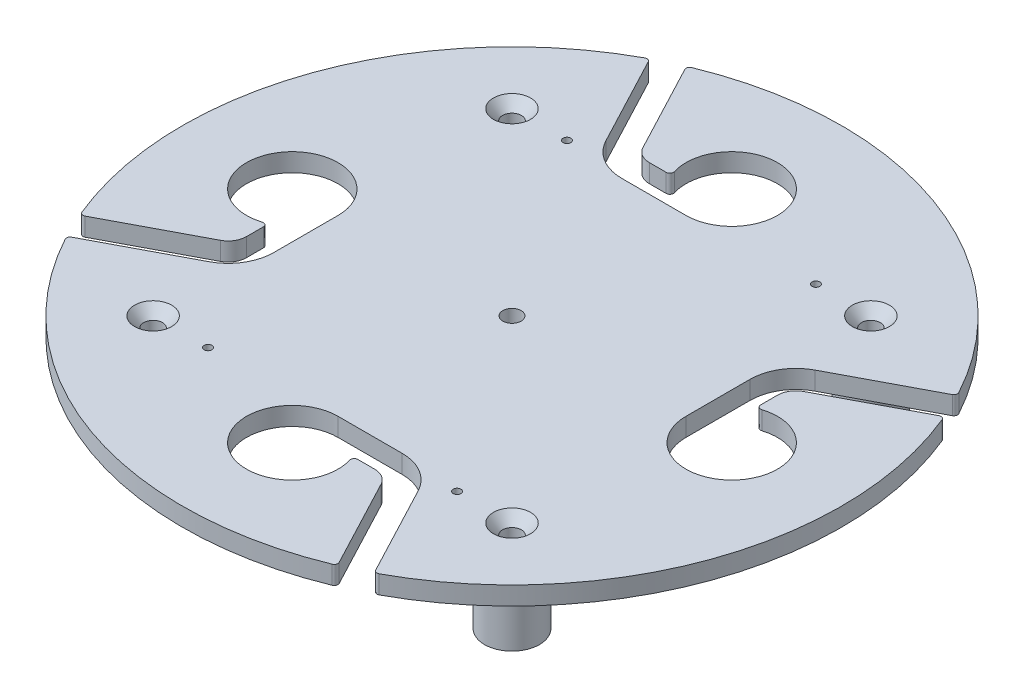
ISO-10303-21;
HEADER;
FILE_DESCRIPTION(('STEP AP214'),'2;1');
FILE_NAME('part.step','',(''),(''),'','','');
FILE_SCHEMA(('AUTOMOTIVE_DESIGN { 1 0 10303 214 1 1 1 1 }'));
ENDSEC;
DATA;
#1=APPLICATION_CONTEXT('core data for automotive mechanical design processes');
#2=APPLICATION_PROTOCOL_DEFINITION('international standard','automotive_design',2000,#1);
#3=PRODUCT_CONTEXT('',#1,'mechanical');
#4=PRODUCT('Part','Part','',(#3));
#5=PRODUCT_RELATED_PRODUCT_CATEGORY('part','',(#4));
#6=PRODUCT_DEFINITION_FORMATION('','',#4);
#7=PRODUCT_DEFINITION_CONTEXT('part definition',#1,'design');
#8=PRODUCT_DEFINITION('design','',#6,#7);
#9=PRODUCT_DEFINITION_SHAPE('','',#8);
#10=(LENGTH_UNIT() NAMED_UNIT(*) SI_UNIT(.MILLI.,.METRE.));
#11=(NAMED_UNIT(*) PLANE_ANGLE_UNIT() SI_UNIT($,.RADIAN.));
#12=(NAMED_UNIT(*) SI_UNIT($,.STERADIAN.) SOLID_ANGLE_UNIT());
#13=UNCERTAINTY_MEASURE_WITH_UNIT(LENGTH_MEASURE(1.E-05),#10,'distance_accuracy_value','');
#14=(GEOMETRIC_REPRESENTATION_CONTEXT(3) GLOBAL_UNCERTAINTY_ASSIGNED_CONTEXT((#13)) GLOBAL_UNIT_ASSIGNED_CONTEXT((#10,
#11,#12)) REPRESENTATION_CONTEXT('',''));
#15=CARTESIAN_POINT('',(0.,0.,0.));
#16=DIRECTION('',(0.,0.,1.));
#17=DIRECTION('',(1.,0.,0.));
#18=AXIS2_PLACEMENT_3D('',#15,#16,#17);
#19=CARTESIAN_POINT('',(0.,0.,0.));
#20=DIRECTION('',(0.,1.,0.));
#21=DIRECTION('',(0.,0.,1.));
#22=AXIS2_PLACEMENT_3D('',#19,#20,#21);
#23=PLANE('',#22);
#24=CARTESIAN_POINT('',(-43.18,0.,-62.23));
#25=DIRECTION('',(0.,1.,0.));
#26=DIRECTION('',(0.,0.,1.));
#27=AXIS2_PLACEMENT_3D('',#24,#25,#26);
#28=CIRCLE('',#27,1.35254999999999);
#29=CARTESIAN_POINT('',(-43.18,0.,-60.87745));
#30=VERTEX_POINT('',#29);
#31=EDGE_CURVE('E1353',#30,#30,#28,.T.);
#32=ORIENTED_EDGE('',*,*,#31,.T.);
#33=EDGE_LOOP('',(#32));
#34=FACE_BOUND('',#33,.T.);
#35=CARTESIAN_POINT('',(43.18,0.,-62.23));
#36=DIRECTION('',(0.,1.,0.));
#37=DIRECTION('',(0.,0.,1.));
#38=AXIS2_PLACEMENT_3D('',#35,#36,#37);
#39=CIRCLE('',#38,1.35254999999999);
#40=CARTESIAN_POINT('',(43.18,0.,-60.87745));
#41=VERTEX_POINT('',#40);
#42=EDGE_CURVE('E1357',#41,#41,#39,.T.);
#43=ORIENTED_EDGE('',*,*,#42,.T.);
#44=EDGE_LOOP('',(#43));
#45=FACE_BOUND('',#44,.T.);
#46=CARTESIAN_POINT('',(43.18,0.,62.23));
#47=DIRECTION('',(0.,1.,0.));
#48=DIRECTION('',(0.,0.,1.));
#49=AXIS2_PLACEMENT_3D('',#46,#47,#48);
#50=CIRCLE('',#49,1.35254999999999);
#51=CARTESIAN_POINT('',(43.18,0.,63.58255));
#52=VERTEX_POINT('',#51);
#53=EDGE_CURVE('E1366',#52,#52,#50,.T.);
#54=ORIENTED_EDGE('',*,*,#53,.T.);
#55=EDGE_LOOP('',(#54));
#56=FACE_BOUND('',#55,.T.);
#57=CARTESIAN_POINT('',(-43.18,0.,62.23));
#58=DIRECTION('',(0.,1.,0.));
#59=DIRECTION('',(0.,0.,1.));
#60=AXIS2_PLACEMENT_3D('',#57,#58,#59);
#61=CIRCLE('',#60,1.35254999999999);
#62=CARTESIAN_POINT('',(-43.18,0.,63.58255));
#63=VERTEX_POINT('',#62);
#64=EDGE_CURVE('E1372',#63,#63,#61,.T.);
#65=ORIENTED_EDGE('',*,*,#64,.T.);
#66=EDGE_LOOP('',(#65));
#67=FACE_BOUND('',#66,.T.);
#68=CARTESIAN_POINT('',(-62.23,0.,-62.23));
#69=DIRECTION('',(0.,1.,0.));
#70=DIRECTION('',(0.,0.,1.));
#71=AXIS2_PLACEMENT_3D('',#68,#69,#70);
#72=CIRCLE('',#71,9.52500000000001);
#73=CARTESIAN_POINT('',(-62.23,0.,-52.705));
#74=VERTEX_POINT('',#73);
#75=EDGE_CURVE('E594',#74,#74,#72,.F.);
#76=ORIENTED_EDGE('',*,*,#75,.F.);
#77=EDGE_LOOP('',(#76));
#78=FACE_BOUND('',#77,.T.);
#79=CARTESIAN_POINT('',(62.23,0.,62.23));
#80=DIRECTION('',(0.,1.,0.));
#81=DIRECTION('',(0.,0.,1.));
#82=AXIS2_PLACEMENT_3D('',#79,#80,#81);
#83=CIRCLE('',#82,9.52500000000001);
#84=CARTESIAN_POINT('',(62.23,0.,71.755));
#85=VERTEX_POINT('',#84);
#86=EDGE_CURVE('E581',#85,#85,#83,.F.);
#87=ORIENTED_EDGE('',*,*,#86,.F.);
#88=EDGE_LOOP('',(#87));
#89=FACE_BOUND('',#88,.T.);
#90=CARTESIAN_POINT('',(0.,0.,0.));
#91=DIRECTION('',(0.,1.,0.));
#92=DIRECTION('',(0.,0.,1.));
#93=AXIS2_PLACEMENT_3D('',#90,#91,#92);
#94=CIRCLE('',#93,114.3);
#95=CARTESIAN_POINT('',(-100.50495160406,0.,54.4356932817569));
#96=VERTEX_POINT('',#95);
#97=CARTESIAN_POINT('',(43.4027377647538,0.,105.738793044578));
#98=VERTEX_POINT('',#97);
#99=EDGE_CURVE('E587',#96,#98,#94,.T.);
#100=ORIENTED_EDGE('',*,*,#99,.F.);
#101=CARTESIAN_POINT('',(-99.3882299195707,0.,53.8308522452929));
#102=DIRECTION('',(0.,1.,0.));
#103=DIRECTION('',(0.,0.,1.));
#104=AXIS2_PLACEMENT_3D('',#101,#102,#103);
#105=CIRCLE('',#104,1.27);
#106=CARTESIAN_POINT('',(-99.9804853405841,0.,52.7074050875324));
#107=VERTEX_POINT('',#106);
#108=EDGE_CURVE('E620',#96,#107,#105,.F.);
#109=ORIENTED_EDGE('',*,*,#108,.T.);
#110=DIRECTION('',(0.88460406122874,0.,-0.466342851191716));
#111=VECTOR('',#110,1.);
#112=CARTESIAN_POINT('',(-68.7968072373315,0.,36.2680894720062));
#113=LINE('',#112,#111);
#114=CARTESIAN_POINT('',(-68.7968072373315,0.,36.2680894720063));
#115=VERTEX_POINT('',#114);
#116=EDGE_CURVE('E406',#107,#115,#113,.T.);
#117=ORIENTED_EDGE('',*,*,#116,.T.);
#118=CARTESIAN_POINT('',(-76.2,0.,22.225));
#119=DIRECTION('',(0.,1.,0.));
#120=DIRECTION('',(0.,0.,1.));
#121=AXIS2_PLACEMENT_3D('',#118,#119,#120);
#122=CIRCLE('',#121,15.875);
#123=CARTESIAN_POINT('',(-60.325,0.,22.225));
#124=VERTEX_POINT('',#123);
#125=EDGE_CURVE('E408',#115,#124,#122,.T.);
#126=ORIENTED_EDGE('',*,*,#125,.T.);
#127=DIRECTION('',(0.,0.,-1.));
#128=VECTOR('',#127,1.);
#129=CARTESIAN_POINT('',(-60.325,0.,0.));
#130=LINE('',#129,#128);
#131=CARTESIAN_POINT('',(-60.325,0.,0.));
#132=VERTEX_POINT('',#131);
#133=EDGE_CURVE('E411',#124,#132,#130,.T.);
#134=ORIENTED_EDGE('',*,*,#133,.T.);
#135=CARTESIAN_POINT('',(-76.2,0.,0.));
#136=DIRECTION('',(0.,1.,0.));
#137=DIRECTION('',(0.,0.,-1.));
#138=AXIS2_PLACEMENT_3D('',#135,#136,#137);
#139=CIRCLE('',#138,15.875);
#140=CARTESIAN_POINT('',(-71.4962962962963,0.,15.1621501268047));
#141=VERTEX_POINT('',#140);
#142=EDGE_CURVE('E390',#132,#141,#139,.T.);
#143=ORIENTED_EDGE('',*,*,#142,.T.);
#144=CARTESIAN_POINT('',(-71.12,0.,16.3751221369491));
#145=DIRECTION('',(0.,-1.,0.));
#146=DIRECTION('',(0.,0.,-1.));
#147=AXIS2_PLACEMENT_3D('',#144,#145,#146);
#148=CIRCLE('',#147,1.26999999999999);
#149=CARTESIAN_POINT('',(-69.85,0.,16.3751221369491));
#150=VERTEX_POINT('',#149);
#151=EDGE_CURVE('E393',#141,#150,#148,.T.);
#152=ORIENTED_EDGE('',*,*,#151,.T.);
#153=DIRECTION('',(0.,0.,1.));
#154=VECTOR('',#153,1.);
#155=CARTESIAN_POINT('',(-69.85,0.,22.225));
#156=LINE('',#155,#154);
#157=CARTESIAN_POINT('',(-69.85,0.,22.225));
#158=VERTEX_POINT('',#157);
#159=EDGE_CURVE('E397',#150,#158,#156,.T.);
#160=ORIENTED_EDGE('',*,*,#159,.T.);
#161=CARTESIAN_POINT('',(-76.2,0.,22.225));
#162=DIRECTION('',(0.,-1.,0.));
#163=DIRECTION('',(0.,0.,-1.));
#164=AXIS2_PLACEMENT_3D('',#161,#162,#163);
#165=CIRCLE('',#164,6.35);
#166=CARTESIAN_POINT('',(-73.2387228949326,0.,27.8422357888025));
#167=VERTEX_POINT('',#166);
#168=EDGE_CURVE('E400',#158,#167,#165,.T.);
#169=ORIENTED_EDGE('',*,*,#168,.T.);
#170=DIRECTION('',(-0.88460406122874,0.,0.466342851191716));
#171=VECTOR('',#170,1.);
#172=CARTESIAN_POINT('',(-105.803234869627,0.,45.0094951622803));
#173=LINE('',#172,#171);
#174=CARTESIAN_POINT('',(-103.971662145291,0.,44.0439322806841));
#175=VERTEX_POINT('',#174);
#176=EDGE_CURVE('E403',#167,#175,#173,.T.);
#177=ORIENTED_EDGE('',*,*,#176,.T.);
#178=CARTESIAN_POINT('',(-104.563917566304,0.,42.9204851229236));
#179=DIRECTION('',(0.,1.,0.));
#180=DIRECTION('',(0.,0.,1.));
#181=AXIS2_PLACEMENT_3D('',#178,#179,#180);
#182=CIRCLE('',#181,1.27);
#183=CARTESIAN_POINT('',(-105.738793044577,0.,43.4027377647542));
#184=VERTEX_POINT('',#183);
#185=EDGE_CURVE('E618',#175,#184,#182,.F.);
#186=ORIENTED_EDGE('',*,*,#185,.T.);
#187=CARTESIAN_POINT('',(-54.4356932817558,0.,-100.504951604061));
#188=VERTEX_POINT('',#187);
#189=EDGE_CURVE('E694',#188,#184,#94,.T.);
#190=ORIENTED_EDGE('',*,*,#189,.F.);
#191=CARTESIAN_POINT('',(-53.8308522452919,0.,-99.3882299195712));
#192=DIRECTION('',(0.,1.,0.));
#193=DIRECTION('',(0.,0.,1.));
#194=AXIS2_PLACEMENT_3D('',#191,#192,#193);
#195=CIRCLE('',#194,1.27);
#196=CARTESIAN_POINT('',(-52.7074050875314,0.,-99.9804853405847));
#197=VERTEX_POINT('',#196);
#198=EDGE_CURVE('E616',#188,#197,#195,.F.);
#199=ORIENTED_EDGE('',*,*,#198,.T.);
#200=DIRECTION('',(0.466342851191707,0.,0.884604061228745));
#201=VECTOR('',#200,1.);
#202=CARTESIAN_POINT('',(-36.2680894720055,0.,-68.7968072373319));
#203=LINE('',#202,#201);
#204=CARTESIAN_POINT('',(-36.2680894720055,0.,-68.7968072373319));
#205=VERTEX_POINT('',#204);
#206=EDGE_CURVE('E357',#197,#205,#203,.T.);
#207=ORIENTED_EDGE('',*,*,#206,.T.);
#208=CARTESIAN_POINT('',(-22.2249999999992,0.,-76.2000000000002));
#209=DIRECTION('',(0.,1.,0.));
#210=DIRECTION('',(-1.,0.,0.));
#211=AXIS2_PLACEMENT_3D('',#208,#209,#210);
#212=CIRCLE('',#211,15.875);
#213=CARTESIAN_POINT('',(-22.2249999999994,0.,-60.3250000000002));
#214=VERTEX_POINT('',#213);
#215=EDGE_CURVE('E359',#205,#214,#212,.T.);
#216=ORIENTED_EDGE('',*,*,#215,.T.);
#217=DIRECTION('',(1.,0.,0.));
#218=VECTOR('',#217,1.);
#219=CARTESIAN_POINT('',(6.31870835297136E-13,0.,-60.325));
#220=LINE('',#219,#218);
#221=CARTESIAN_POINT('',(6.31870835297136E-13,0.,-60.325));
#222=VERTEX_POINT('',#221);
#223=EDGE_CURVE('E327',#214,#222,#220,.T.);
#224=ORIENTED_EDGE('',*,*,#223,.T.);
#225=CARTESIAN_POINT('',(7.9815263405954E-13,0.,-76.2));
#226=DIRECTION('',(0.,1.,0.));
#227=DIRECTION('',(1.,0.,0.));
#228=AXIS2_PLACEMENT_3D('',#225,#226,#227);
#229=CIRCLE('',#228,15.875);
#230=CARTESIAN_POINT('',(-15.162150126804,0.,-71.4962962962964));
#231=VERTEX_POINT('',#230);
#232=EDGE_CURVE('E319',#222,#231,#229,.T.);
#233=ORIENTED_EDGE('',*,*,#232,.T.);
#234=CARTESIAN_POINT('',(-16.3751221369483,0.,-71.1200000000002));
#235=DIRECTION('',(0.,-1.,0.));
#236=DIRECTION('',(1.,0.,0.));
#237=AXIS2_PLACEMENT_3D('',#234,#235,#236);
#238=CIRCLE('',#237,1.26999999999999);
#239=CARTESIAN_POINT('',(-16.3751221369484,0.,-69.8500000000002));
#240=VERTEX_POINT('',#239);
#241=EDGE_CURVE('E330',#231,#240,#238,.T.);
#242=ORIENTED_EDGE('',*,*,#241,.T.);
#243=DIRECTION('',(-1.,0.,0.));
#244=VECTOR('',#243,1.);
#245=CARTESIAN_POINT('',(-22.2249999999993,0.,-69.8500000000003));
#246=LINE('',#245,#244);
#247=CARTESIAN_POINT('',(-22.2249999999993,0.,-69.8500000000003));
#248=VERTEX_POINT('',#247);
#249=EDGE_CURVE('E335',#240,#248,#246,.T.);
#250=ORIENTED_EDGE('',*,*,#249,.T.);
#251=CARTESIAN_POINT('',(-22.2249999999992,0.,-76.2000000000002));
#252=DIRECTION('',(0.,-1.,0.));
#253=DIRECTION('',(1.,0.,0.));
#254=AXIS2_PLACEMENT_3D('',#251,#252,#253);
#255=CIRCLE('',#254,6.35);
#256=CARTESIAN_POINT('',(-27.8422357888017,0.,-73.2387228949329));
#257=VERTEX_POINT('',#256);
#258=EDGE_CURVE('E351',#248,#257,#255,.T.);
#259=ORIENTED_EDGE('',*,*,#258,.T.);
#260=DIRECTION('',(-0.466342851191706,0.,-0.884604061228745));
#261=VECTOR('',#260,1.);
#262=CARTESIAN_POINT('',(-45.0094951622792,0.,-105.803234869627));
#263=LINE('',#262,#261);
#264=CARTESIAN_POINT('',(-44.043932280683,0.,-103.971662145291));
#265=VERTEX_POINT('',#264);
#266=EDGE_CURVE('E354',#257,#265,#263,.T.);
#267=ORIENTED_EDGE('',*,*,#266,.T.);
#268=CARTESIAN_POINT('',(-42.9204851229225,0.,-104.563917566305));
#269=DIRECTION('',(0.,1.,0.));
#270=DIRECTION('',(0.,0.,1.));
#271=AXIS2_PLACEMENT_3D('',#268,#269,#270);
#272=CIRCLE('',#271,1.27);
#273=CARTESIAN_POINT('',(-43.4027377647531,0.,-105.738793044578));
#274=VERTEX_POINT('',#273);
#275=EDGE_CURVE('E614',#265,#274,#272,.F.);
#276=ORIENTED_EDGE('',*,*,#275,.T.);
#277=CARTESIAN_POINT('',(100.50495160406,0.,-54.4356932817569));
#278=VERTEX_POINT('',#277);
#279=EDGE_CURVE('E588',#278,#274,#94,.T.);
#280=ORIENTED_EDGE('',*,*,#279,.F.);
#281=CARTESIAN_POINT('',(99.3882299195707,0.,-53.8308522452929));
#282=DIRECTION('',(0.,1.,0.));
#283=DIRECTION('',(0.,0.,1.));
#284=AXIS2_PLACEMENT_3D('',#281,#282,#283);
#285=CIRCLE('',#284,1.27);
#286=CARTESIAN_POINT('',(99.9804853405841,0.,-52.7074050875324));
#287=VERTEX_POINT('',#286);
#288=EDGE_CURVE('E612',#278,#287,#285,.F.);
#289=ORIENTED_EDGE('',*,*,#288,.T.);
#290=DIRECTION('',(-0.88460406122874,0.,0.466342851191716));
#291=VECTOR('',#290,1.);
#292=CARTESIAN_POINT('',(68.7968072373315,0.,-36.2680894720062));
#293=LINE('',#292,#291);
#294=CARTESIAN_POINT('',(68.7968072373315,0.,-36.2680894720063));
#295=VERTEX_POINT('',#294);
#296=EDGE_CURVE('E528',#287,#295,#293,.T.);
#297=ORIENTED_EDGE('',*,*,#296,.T.);
#298=CARTESIAN_POINT('',(76.2,0.,-22.225));
#299=DIRECTION('',(0.,1.,0.));
#300=DIRECTION('',(0.,0.,-1.));
#301=AXIS2_PLACEMENT_3D('',#298,#299,#300);
#302=CIRCLE('',#301,15.875);
#303=CARTESIAN_POINT('',(60.325,0.,-22.225));
#304=VERTEX_POINT('',#303);
#305=EDGE_CURVE('E530',#295,#304,#302,.T.);
#306=ORIENTED_EDGE('',*,*,#305,.T.);
#307=DIRECTION('',(0.,0.,1.));
#308=VECTOR('',#307,1.);
#309=CARTESIAN_POINT('',(60.325,0.,0.));
#310=LINE('',#309,#308);
#311=CARTESIAN_POINT('',(60.325,0.,0.));
#312=VERTEX_POINT('',#311);
#313=EDGE_CURVE('E533',#304,#312,#310,.T.);
#314=ORIENTED_EDGE('',*,*,#313,.T.);
#315=CARTESIAN_POINT('',(76.2,0.,0.));
#316=DIRECTION('',(0.,1.,0.));
#317=DIRECTION('',(0.,0.,1.));
#318=AXIS2_PLACEMENT_3D('',#315,#316,#317);
#319=CIRCLE('',#318,15.875);
#320=CARTESIAN_POINT('',(71.4962962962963,0.,-15.1621501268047));
#321=VERTEX_POINT('',#320);
#322=EDGE_CURVE('E512',#312,#321,#319,.T.);
#323=ORIENTED_EDGE('',*,*,#322,.T.);
#324=CARTESIAN_POINT('',(71.12,0.,-16.3751221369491));
#325=DIRECTION('',(0.,-1.,0.));
#326=DIRECTION('',(0.,0.,1.));
#327=AXIS2_PLACEMENT_3D('',#324,#325,#326);
#328=CIRCLE('',#327,1.26999999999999);
#329=CARTESIAN_POINT('',(69.85,0.,-16.3751221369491));
#330=VERTEX_POINT('',#329);
#331=EDGE_CURVE('E515',#321,#330,#328,.T.);
#332=ORIENTED_EDGE('',*,*,#331,.T.);
#333=DIRECTION('',(0.,0.,-1.));
#334=VECTOR('',#333,1.);
#335=CARTESIAN_POINT('',(69.85,0.,-22.225));
#336=LINE('',#335,#334);
#337=CARTESIAN_POINT('',(69.85,0.,-22.225));
#338=VERTEX_POINT('',#337);
#339=EDGE_CURVE('E519',#330,#338,#336,.T.);
#340=ORIENTED_EDGE('',*,*,#339,.T.);
#341=CARTESIAN_POINT('',(76.2,0.,-22.225));
#342=DIRECTION('',(0.,-1.,0.));
#343=DIRECTION('',(0.,0.,1.));
#344=AXIS2_PLACEMENT_3D('',#341,#342,#343);
#345=CIRCLE('',#344,6.35);
#346=CARTESIAN_POINT('',(73.2387228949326,0.,-27.8422357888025));
#347=VERTEX_POINT('',#346);
#348=EDGE_CURVE('E522',#338,#347,#345,.T.);
#349=ORIENTED_EDGE('',*,*,#348,.T.);
#350=DIRECTION('',(0.88460406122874,0.,-0.466342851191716));
#351=VECTOR('',#350,1.);
#352=CARTESIAN_POINT('',(105.803234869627,0.,-45.0094951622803));
#353=LINE('',#352,#351);
#354=CARTESIAN_POINT('',(103.971662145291,0.,-44.0439322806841));
#355=VERTEX_POINT('',#354);
#356=EDGE_CURVE('E525',#347,#355,#353,.T.);
#357=ORIENTED_EDGE('',*,*,#356,.T.);
#358=CARTESIAN_POINT('',(104.563917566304,0.,-42.9204851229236));
#359=DIRECTION('',(0.,1.,0.));
#360=DIRECTION('',(0.,0.,1.));
#361=AXIS2_PLACEMENT_3D('',#358,#359,#360);
#362=CIRCLE('',#361,1.27);
#363=CARTESIAN_POINT('',(105.738793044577,0.,-43.4027377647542));
#364=VERTEX_POINT('',#363);
#365=EDGE_CURVE('E610',#355,#364,#362,.F.);
#366=ORIENTED_EDGE('',*,*,#365,.T.);
#367=CARTESIAN_POINT('',(54.4356932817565,0.,100.50495160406));
#368=VERTEX_POINT('',#367);
#369=EDGE_CURVE('E576',#368,#364,#94,.T.);
#370=ORIENTED_EDGE('',*,*,#369,.F.);
#371=CARTESIAN_POINT('',(53.8308522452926,0.,99.3882299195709));
#372=DIRECTION('',(0.,1.,0.));
#373=DIRECTION('',(0.,0.,1.));
#374=AXIS2_PLACEMENT_3D('',#371,#372,#373);
#375=CIRCLE('',#374,1.27);
#376=CARTESIAN_POINT('',(52.7074050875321,0.,99.9804853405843));
#377=VERTEX_POINT('',#376);
#378=EDGE_CURVE('E608',#368,#377,#375,.F.);
#379=ORIENTED_EDGE('',*,*,#378,.T.);
#380=DIRECTION('',(-0.466342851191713,0.,-0.884604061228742));
#381=VECTOR('',#380,1.);
#382=CARTESIAN_POINT('',(36.268089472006,0.,68.7968072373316));
#383=LINE('',#382,#381);
#384=CARTESIAN_POINT('',(36.268089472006,0.,68.7968072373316));
#385=VERTEX_POINT('',#384);
#386=EDGE_CURVE('E467',#377,#385,#383,.T.);
#387=ORIENTED_EDGE('',*,*,#386,.T.);
#388=CARTESIAN_POINT('',(22.2249999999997,0.,76.2000000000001));
#389=DIRECTION('',(0.,1.,0.));
#390=DIRECTION('',(1.,0.,0.));
#391=AXIS2_PLACEMENT_3D('',#388,#389,#390);
#392=CIRCLE('',#391,15.875);
#393=CARTESIAN_POINT('',(22.2249999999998,0.,60.3250000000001));
#394=VERTEX_POINT('',#393);
#395=EDGE_CURVE('E469',#385,#394,#392,.T.);
#396=ORIENTED_EDGE('',*,*,#395,.T.);
#397=DIRECTION('',(-1.,0.,0.));
#398=VECTOR('',#397,1.);
#399=CARTESIAN_POINT('',(-2.10623611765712E-13,0.,60.325));
#400=LINE('',#399,#398);
#401=CARTESIAN_POINT('',(-2.10623611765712E-13,0.,60.325));
#402=VERTEX_POINT('',#401);
#403=EDGE_CURVE('E472',#394,#402,#400,.T.);
#404=ORIENTED_EDGE('',*,*,#403,.T.);
#405=CARTESIAN_POINT('',(-2.66050878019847E-13,0.,76.2));
#406=DIRECTION('',(0.,1.,0.));
#407=DIRECTION('',(-1.,0.,0.));
#408=AXIS2_PLACEMENT_3D('',#405,#406,#407);
#409=CIRCLE('',#408,15.875);
#410=CARTESIAN_POINT('',(15.1621501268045,0.,71.4962962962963));
#411=VERTEX_POINT('',#410);
#412=EDGE_CURVE('E451',#402,#411,#409,.T.);
#413=ORIENTED_EDGE('',*,*,#412,.T.);
#414=CARTESIAN_POINT('',(16.3751221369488,0.,71.12));
#415=DIRECTION('',(0.,-1.,0.));
#416=DIRECTION('',(-1.,0.,0.));
#417=AXIS2_PLACEMENT_3D('',#414,#415,#416);
#418=CIRCLE('',#417,1.26999999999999);
#419=CARTESIAN_POINT('',(16.3751221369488,0.,69.8500000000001));
#420=VERTEX_POINT('',#419);
#421=EDGE_CURVE('E454',#411,#420,#418,.T.);
#422=ORIENTED_EDGE('',*,*,#421,.T.);
#423=DIRECTION('',(1.,0.,0.));
#424=VECTOR('',#423,1.);
#425=CARTESIAN_POINT('',(22.2249999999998,0.,69.8500000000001));
#426=LINE('',#425,#424);
#427=CARTESIAN_POINT('',(22.2249999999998,0.,69.8500000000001));
#428=VERTEX_POINT('',#427);
#429=EDGE_CURVE('E458',#420,#428,#426,.T.);
#430=ORIENTED_EDGE('',*,*,#429,.T.);
#431=CARTESIAN_POINT('',(22.2249999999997,0.,76.2000000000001));
#432=DIRECTION('',(0.,-1.,0.));
#433=DIRECTION('',(-1.,0.,0.));
#434=AXIS2_PLACEMENT_3D('',#431,#432,#433);
#435=CIRCLE('',#434,6.35);
#436=CARTESIAN_POINT('',(27.8422357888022,0.,73.2387228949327));
#437=VERTEX_POINT('',#436);
#438=EDGE_CURVE('E461',#428,#437,#435,.T.);
#439=ORIENTED_EDGE('',*,*,#438,.T.);
#440=DIRECTION('',(0.466342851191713,0.,0.884604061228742));
#441=VECTOR('',#440,1.);
#442=CARTESIAN_POINT('',(45.00949516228,0.,105.803234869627));
#443=LINE('',#442,#441);
#444=CARTESIAN_POINT('',(44.0439322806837,0.,103.971662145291));
#445=VERTEX_POINT('',#444);
#446=EDGE_CURVE('E464',#437,#445,#443,.T.);
#447=ORIENTED_EDGE('',*,*,#446,.T.);
#448=CARTESIAN_POINT('',(42.9204851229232,0.,104.563917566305));
#449=DIRECTION('',(0.,1.,0.));
#450=DIRECTION('',(0.,0.,1.));
#451=AXIS2_PLACEMENT_3D('',#448,#449,#450);
#452=CIRCLE('',#451,1.27);
#453=EDGE_CURVE('E606',#445,#98,#452,.F.);
#454=ORIENTED_EDGE('',*,*,#453,.T.);
#455=EDGE_LOOP('',(#100,#109,#117,#126,#134,#143,#152,#160,#169,#177,#186,#190,#199,#207,#216,
#224,#233,#242,#250,#259,#267,#276,#280,#289,#297,#306,#314,#323,#332,#340,#349,#357,#366,#370,
#379,#387,#396,#404,#413,#422,#430,#439,#447,#454));
#456=FACE_BOUND('',#455,.T.);
#457=CARTESIAN_POINT('',(0.,0.,0.));
#458=DIRECTION('',(0.,1.,0.));
#459=DIRECTION('',(0.,0.,1.));
#460=AXIS2_PLACEMENT_3D('',#457,#458,#459);
#461=CIRCLE('',#460,3.175);
#462=CARTESIAN_POINT('',(0.,0.,3.175));
#463=VERTEX_POINT('',#462);
#464=EDGE_CURVE('E560',#463,#463,#461,.T.);
#465=ORIENTED_EDGE('',*,*,#464,.T.);
#466=EDGE_LOOP('',(#465));
#467=FACE_BOUND('',#466,.T.);
#468=CARTESIAN_POINT('',(-62.2300000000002,0.,62.2299999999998));
#469=DIRECTION('',(0.,1.,0.));
#470=DIRECTION('',(0.,0.,1.));
#471=AXIS2_PLACEMENT_3D('',#468,#469,#470);
#472=CIRCLE('',#471,9.52500000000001);
#473=CARTESIAN_POINT('',(-62.2300000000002,0.,71.7549999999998));
#474=VERTEX_POINT('',#473);
#475=EDGE_CURVE('E591',#474,#474,#472,.F.);
#476=ORIENTED_EDGE('',*,*,#475,.F.);
#477=EDGE_LOOP('',(#476));
#478=FACE_BOUND('',#477,.T.);
#479=CARTESIAN_POINT('',(62.2300000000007,0.,-62.2299999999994));
#480=DIRECTION('',(0.,1.,0.));
#481=DIRECTION('',(0.,0.,1.));
#482=AXIS2_PLACEMENT_3D('',#479,#480,#481);
#483=CIRCLE('',#482,9.52500000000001);
#484=CARTESIAN_POINT('',(62.2300000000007,0.,-52.7049999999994));
#485=VERTEX_POINT('',#484);
#486=EDGE_CURVE('E597',#485,#485,#483,.F.);
#487=ORIENTED_EDGE('',*,*,#486,.F.);
#488=EDGE_LOOP('',(#487));
#489=FACE_BOUND('',#488,.T.);
#490=ADVANCED_FACE('F34',(#34,#45,#56,#67,#78,#89,#456,#467,#478,#489),#23,.F.);
#491=CARTESIAN_POINT('',(0.,6.35,0.));
#492=DIRECTION('',(0.,-1.,0.));
#493=DIRECTION('',(0.,0.,-1.));
#494=AXIS2_PLACEMENT_3D('',#491,#492,#493);
#495=CYLINDRICAL_SURFACE('',#494,114.3);
#496=ORIENTED_EDGE('',*,*,#189,.T.);
#497=DIRECTION('',(0.,-1.,0.));
#498=VECTOR('',#497,1.);
#499=CARTESIAN_POINT('',(-105.738793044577,6.35,43.4027377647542));
#500=LINE('',#499,#498);
#501=CARTESIAN_POINT('',(-105.738793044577,6.35,43.4027377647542));
#502=VERTEX_POINT('',#501);
#503=EDGE_CURVE('E642',#184,#502,#500,.F.);
#504=ORIENTED_EDGE('',*,*,#503,.T.);
#505=CARTESIAN_POINT('',(0.,6.35,0.));
#506=DIRECTION('',(0.,1.,0.));
#507=DIRECTION('',(0.,0.,1.));
#508=AXIS2_PLACEMENT_3D('',#505,#506,#507);
#509=CIRCLE('',#508,114.3);
#510=CARTESIAN_POINT('',(-54.4356932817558,6.35,-100.504951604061));
#511=VERTEX_POINT('',#510);
#512=EDGE_CURVE('E582',#511,#502,#509,.T.);
#513=ORIENTED_EDGE('',*,*,#512,.F.);
#514=DIRECTION('',(0.,-1.,0.));
#515=VECTOR('',#514,1.);
#516=CARTESIAN_POINT('',(-54.4356932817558,6.35,-100.504951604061));
#517=LINE('',#516,#515);
#518=EDGE_CURVE('E639',#511,#188,#517,.T.);
#519=ORIENTED_EDGE('',*,*,#518,.T.);
#520=EDGE_LOOP('',(#496,#504,#513,#519));
#521=FACE_BOUND('',#520,.T.);
#522=ADVANCED_FACE('F703',(#521),#495,.T.);
#523=CARTESIAN_POINT('',(-100.50495160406,6.35,54.4356932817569));
#524=VERTEX_POINT('',#523);
#525=CARTESIAN_POINT('',(43.4027377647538,6.35,105.738793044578));
#526=VERTEX_POINT('',#525);
#527=EDGE_CURVE('E584',#524,#526,#509,.T.);
#528=ORIENTED_EDGE('',*,*,#527,.F.);
#529=DIRECTION('',(0.,-1.,0.));
#530=VECTOR('',#529,1.);
#531=CARTESIAN_POINT('',(-100.50495160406,6.35,54.4356932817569));
#532=LINE('',#531,#530);
#533=EDGE_CURVE('E603',#524,#96,#532,.T.);
#534=ORIENTED_EDGE('',*,*,#533,.T.);
#535=ORIENTED_EDGE('',*,*,#99,.T.);
#536=DIRECTION('',(0.,-1.,0.));
#537=VECTOR('',#536,1.);
#538=CARTESIAN_POINT('',(43.4027377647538,6.35,105.738793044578));
#539=LINE('',#538,#537);
#540=EDGE_CURVE('E600',#98,#526,#539,.F.);
#541=ORIENTED_EDGE('',*,*,#540,.T.);
#542=EDGE_LOOP('',(#528,#534,#535,#541));
#543=FACE_BOUND('',#542,.T.);
#544=ADVANCED_FACE('F788',(#543),#495,.T.);
#545=ORIENTED_EDGE('',*,*,#369,.T.);
#546=DIRECTION('',(0.,-1.,0.));
#547=VECTOR('',#546,1.);
#548=CARTESIAN_POINT('',(105.738793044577,6.35,-43.4027377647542));
#549=LINE('',#548,#547);
#550=CARTESIAN_POINT('',(105.738793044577,6.35,-43.4027377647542));
#551=VERTEX_POINT('',#550);
#552=EDGE_CURVE('E661',#364,#551,#549,.F.);
#553=ORIENTED_EDGE('',*,*,#552,.T.);
#554=CARTESIAN_POINT('',(54.4356932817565,6.35,100.50495160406));
#555=VERTEX_POINT('',#554);
#556=EDGE_CURVE('E583',#555,#551,#509,.T.);
#557=ORIENTED_EDGE('',*,*,#556,.F.);
#558=DIRECTION('',(0.,-1.,0.));
#559=VECTOR('',#558,1.);
#560=CARTESIAN_POINT('',(54.4356932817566,6.35,100.50495160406));
#561=LINE('',#560,#559);
#562=EDGE_CURVE('E658',#555,#368,#561,.T.);
#563=ORIENTED_EDGE('',*,*,#562,.T.);
#564=EDGE_LOOP('',(#545,#553,#557,#563));
#565=FACE_BOUND('',#564,.T.);
#566=ADVANCED_FACE('F684',(#565),#495,.T.);
#567=CARTESIAN_POINT('',(0.,6.35,0.));
#568=DIRECTION('',(0.,1.,0.));
#569=DIRECTION('',(0.,0.,1.));
#570=AXIS2_PLACEMENT_3D('',#567,#568,#569);
#571=PLANE('',#570);
#572=CARTESIAN_POINT('',(-43.18,6.35,-62.23));
#573=DIRECTION('',(0.,1.,0.));
#574=DIRECTION('',(0.,0.,1.));
#575=AXIS2_PLACEMENT_3D('',#572,#573,#574);
#576=CIRCLE('',#575,1.35254999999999);
#577=CARTESIAN_POINT('',(-43.18,6.35,-60.87745));
#578=VERTEX_POINT('',#577);
#579=EDGE_CURVE('E1351',#578,#578,#576,.T.);
#580=ORIENTED_EDGE('',*,*,#579,.F.);
#581=EDGE_LOOP('',(#580));
#582=FACE_BOUND('',#581,.T.);
#583=CARTESIAN_POINT('',(43.18,6.35,-62.23));
#584=DIRECTION('',(0.,1.,0.));
#585=DIRECTION('',(0.,0.,1.));
#586=AXIS2_PLACEMENT_3D('',#583,#584,#585);
#587=CIRCLE('',#586,1.35254999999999);
#588=CARTESIAN_POINT('',(43.18,6.35,-60.87745));
#589=VERTEX_POINT('',#588);
#590=EDGE_CURVE('E1354',#589,#589,#587,.T.);
#591=ORIENTED_EDGE('',*,*,#590,.F.);
#592=EDGE_LOOP('',(#591));
#593=FACE_BOUND('',#592,.T.);
#594=CARTESIAN_POINT('',(43.18,6.35,62.23));
#595=DIRECTION('',(0.,1.,0.));
#596=DIRECTION('',(0.,0.,1.));
#597=AXIS2_PLACEMENT_3D('',#594,#595,#596);
#598=CIRCLE('',#597,1.35254999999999);
#599=CARTESIAN_POINT('',(43.18,6.35,63.58255));
#600=VERTEX_POINT('',#599);
#601=EDGE_CURVE('E1363',#600,#600,#598,.T.);
#602=ORIENTED_EDGE('',*,*,#601,.F.);
#603=EDGE_LOOP('',(#602));
#604=FACE_BOUND('',#603,.T.);
#605=CARTESIAN_POINT('',(-43.18,6.35,62.23));
#606=DIRECTION('',(0.,1.,0.));
#607=DIRECTION('',(0.,0.,1.));
#608=AXIS2_PLACEMENT_3D('',#605,#606,#607);
#609=CIRCLE('',#608,1.35254999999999);
#610=CARTESIAN_POINT('',(-43.18,6.35,63.58255));
#611=VERTEX_POINT('',#610);
#612=EDGE_CURVE('E1369',#611,#611,#609,.T.);
#613=ORIENTED_EDGE('',*,*,#612,.F.);
#614=EDGE_LOOP('',(#613));
#615=FACE_BOUND('',#614,.T.);
#616=CARTESIAN_POINT('',(-62.23,6.35,-62.23));
#617=DIRECTION('',(0.,1.,0.));
#618=DIRECTION('',(0.,0.,1.));
#619=AXIS2_PLACEMENT_3D('',#616,#617,#618);
#620=CIRCLE('',#619,6.4389);
#621=CARTESIAN_POINT('',(-62.23,6.35,-55.7911));
#622=VERTEX_POINT('',#621);
#623=EDGE_CURVE('E1399',#622,#622,#620,.T.);
#624=ORIENTED_EDGE('',*,*,#623,.F.);
#625=EDGE_LOOP('',(#624));
#626=FACE_BOUND('',#625,.T.);
#627=CARTESIAN_POINT('',(62.23,6.35,-62.23));
#628=DIRECTION('',(0.,1.,0.));
#629=DIRECTION('',(0.,0.,1.));
#630=AXIS2_PLACEMENT_3D('',#627,#628,#629);
#631=CIRCLE('',#630,6.4389);
#632=CARTESIAN_POINT('',(62.23,6.35,-55.7911));
#633=VERTEX_POINT('',#632);
#634=EDGE_CURVE('E1405',#633,#633,#631,.T.);
#635=ORIENTED_EDGE('',*,*,#634,.F.);
#636=EDGE_LOOP('',(#635));
#637=FACE_BOUND('',#636,.T.);
#638=CARTESIAN_POINT('',(62.23,6.35,62.23));
#639=DIRECTION('',(0.,1.,0.));
#640=DIRECTION('',(0.,0.,1.));
#641=AXIS2_PLACEMENT_3D('',#638,#639,#640);
#642=CIRCLE('',#641,6.4389);
#643=CARTESIAN_POINT('',(62.23,6.35,68.6689));
#644=VERTEX_POINT('',#643);
#645=EDGE_CURVE('E1411',#644,#644,#642,.T.);
#646=ORIENTED_EDGE('',*,*,#645,.F.);
#647=EDGE_LOOP('',(#646));
#648=FACE_BOUND('',#647,.T.);
#649=CARTESIAN_POINT('',(-62.23,6.35,62.23));
#650=DIRECTION('',(0.,1.,0.));
#651=DIRECTION('',(0.,0.,1.));
#652=AXIS2_PLACEMENT_3D('',#649,#650,#651);
#653=CIRCLE('',#652,6.4389);
#654=CARTESIAN_POINT('',(-62.23,6.35,68.6689));
#655=VERTEX_POINT('',#654);
#656=EDGE_CURVE('E1416',#655,#655,#653,.T.);
#657=ORIENTED_EDGE('',*,*,#656,.F.);
#658=EDGE_LOOP('',(#657));
#659=FACE_BOUND('',#658,.T.);
#660=DIRECTION('',(0.88460406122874,0.,-0.466342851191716));
#661=VECTOR('',#660,1.);
#662=CARTESIAN_POINT('',(-68.7968072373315,6.35,36.2680894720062));
#663=LINE('',#662,#661);
#664=CARTESIAN_POINT('',(-99.9804853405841,6.35,52.7074050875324));
#665=VERTEX_POINT('',#664);
#666=CARTESIAN_POINT('',(-68.7968072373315,6.35,36.2680894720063));
#667=VERTEX_POINT('',#666);
#668=EDGE_CURVE('E429',#665,#667,#663,.T.);
#669=ORIENTED_EDGE('',*,*,#668,.F.);
#670=CARTESIAN_POINT('',(-99.3882299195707,6.35,53.8308522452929));
#671=DIRECTION('',(0.,1.,0.));
#672=DIRECTION('',(0.,0.,1.));
#673=AXIS2_PLACEMENT_3D('',#670,#671,#672);
#674=CIRCLE('',#673,1.27);
#675=EDGE_CURVE('E637',#665,#524,#674,.T.);
#676=ORIENTED_EDGE('',*,*,#675,.T.);
#677=ORIENTED_EDGE('',*,*,#527,.T.);
#678=CARTESIAN_POINT('',(42.9204851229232,6.35,104.563917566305));
#679=DIRECTION('',(0.,1.,0.));
#680=DIRECTION('',(0.,0.,1.));
#681=AXIS2_PLACEMENT_3D('',#678,#679,#680);
#682=CIRCLE('',#681,1.27);
#683=CARTESIAN_POINT('',(44.0439322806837,6.35,103.971662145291));
#684=VERTEX_POINT('',#683);
#685=EDGE_CURVE('E624',#526,#684,#682,.T.);
#686=ORIENTED_EDGE('',*,*,#685,.T.);
#687=DIRECTION('',(0.466342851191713,0.,0.884604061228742));
#688=VECTOR('',#687,1.);
#689=CARTESIAN_POINT('',(45.00949516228,6.35,105.803234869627));
#690=LINE('',#689,#688);
#691=CARTESIAN_POINT('',(27.8422357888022,6.35,73.2387228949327));
#692=VERTEX_POINT('',#691);
#693=EDGE_CURVE('E487',#692,#684,#690,.T.);
#694=ORIENTED_EDGE('',*,*,#693,.F.);
#695=CARTESIAN_POINT('',(22.2249999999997,6.35,76.2000000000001));
#696=DIRECTION('',(0.,-1.,0.));
#697=DIRECTION('',(-1.,0.,0.));
#698=AXIS2_PLACEMENT_3D('',#695,#696,#697);
#699=CIRCLE('',#698,6.35);
#700=CARTESIAN_POINT('',(22.2249999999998,6.35,69.8500000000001));
#701=VERTEX_POINT('',#700);
#702=EDGE_CURVE('E484',#701,#692,#699,.T.);
#703=ORIENTED_EDGE('',*,*,#702,.F.);
#704=DIRECTION('',(1.,0.,0.));
#705=VECTOR('',#704,1.);
#706=CARTESIAN_POINT('',(22.2249999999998,6.35,69.8500000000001));
#707=LINE('',#706,#705);
#708=CARTESIAN_POINT('',(16.3751221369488,6.35,69.8500000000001));
#709=VERTEX_POINT('',#708);
#710=EDGE_CURVE('E481',#709,#701,#707,.T.);
#711=ORIENTED_EDGE('',*,*,#710,.F.);
#712=CARTESIAN_POINT('',(16.3751221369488,6.35,71.12));
#713=DIRECTION('',(0.,-1.,0.));
#714=DIRECTION('',(-1.,0.,0.));
#715=AXIS2_PLACEMENT_3D('',#712,#713,#714);
#716=CIRCLE('',#715,1.26999999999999);
#717=CARTESIAN_POINT('',(15.1621501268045,6.35,71.4962962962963));
#718=VERTEX_POINT('',#717);
#719=EDGE_CURVE('E478',#718,#709,#716,.T.);
#720=ORIENTED_EDGE('',*,*,#719,.F.);
#721=CARTESIAN_POINT('',(-2.66050878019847E-13,6.35,76.2));
#722=DIRECTION('',(0.,1.,0.));
#723=DIRECTION('',(-1.,0.,0.));
#724=AXIS2_PLACEMENT_3D('',#721,#722,#723);
#725=CIRCLE('',#724,15.875);
#726=CARTESIAN_POINT('',(-2.10623611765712E-13,6.35,60.325));
#727=VERTEX_POINT('',#726);
#728=EDGE_CURVE('E438',#727,#718,#725,.T.);
#729=ORIENTED_EDGE('',*,*,#728,.F.);
#730=DIRECTION('',(-1.,0.,0.));
#731=VECTOR('',#730,1.);
#732=CARTESIAN_POINT('',(-2.10623611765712E-13,6.35,60.325));
#733=LINE('',#732,#731);
#734=CARTESIAN_POINT('',(22.2249999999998,6.35,60.3250000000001));
#735=VERTEX_POINT('',#734);
#736=EDGE_CURVE('E455',#735,#727,#733,.T.);
#737=ORIENTED_EDGE('',*,*,#736,.F.);
#738=CARTESIAN_POINT('',(22.2249999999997,6.35,76.2000000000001));
#739=DIRECTION('',(0.,1.,0.));
#740=DIRECTION('',(1.,0.,0.));
#741=AXIS2_PLACEMENT_3D('',#738,#739,#740);
#742=CIRCLE('',#741,15.875);
#743=CARTESIAN_POINT('',(36.268089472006,6.35,68.7968072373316));
#744=VERTEX_POINT('',#743);
#745=EDGE_CURVE('E492',#744,#735,#742,.T.);
#746=ORIENTED_EDGE('',*,*,#745,.F.);
#747=DIRECTION('',(-0.466342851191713,0.,-0.884604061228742));
#748=VECTOR('',#747,1.);
#749=CARTESIAN_POINT('',(36.268089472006,6.35,68.7968072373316));
#750=LINE('',#749,#748);
#751=CARTESIAN_POINT('',(52.7074050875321,6.35,99.9804853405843));
#752=VERTEX_POINT('',#751);
#753=EDGE_CURVE('E490',#752,#744,#750,.T.);
#754=ORIENTED_EDGE('',*,*,#753,.F.);
#755=CARTESIAN_POINT('',(53.8308522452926,6.35,99.3882299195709));
#756=DIRECTION('',(0.,1.,0.));
#757=DIRECTION('',(0.,0.,1.));
#758=AXIS2_PLACEMENT_3D('',#755,#756,#757);
#759=CIRCLE('',#758,1.27);
#760=EDGE_CURVE('E626',#752,#555,#759,.T.);
#761=ORIENTED_EDGE('',*,*,#760,.T.);
#762=ORIENTED_EDGE('',*,*,#556,.T.);
#763=CARTESIAN_POINT('',(104.563917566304,6.35,-42.9204851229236));
#764=DIRECTION('',(0.,1.,0.));
#765=DIRECTION('',(0.,0.,1.));
#766=AXIS2_PLACEMENT_3D('',#763,#764,#765);
#767=CIRCLE('',#766,1.27);
#768=CARTESIAN_POINT('',(103.971662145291,6.35,-44.0439322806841));
#769=VERTEX_POINT('',#768);
#770=EDGE_CURVE('E628',#551,#769,#767,.T.);
#771=ORIENTED_EDGE('',*,*,#770,.T.);
#772=DIRECTION('',(0.88460406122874,0.,-0.466342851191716));
#773=VECTOR('',#772,1.);
#774=CARTESIAN_POINT('',(105.803234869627,6.35,-45.0094951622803));
#775=LINE('',#774,#773);
#776=CARTESIAN_POINT('',(73.2387228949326,6.35,-27.8422357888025));
#777=VERTEX_POINT('',#776);
#778=EDGE_CURVE('E548',#777,#769,#775,.T.);
#779=ORIENTED_EDGE('',*,*,#778,.F.);
#780=CARTESIAN_POINT('',(76.2,6.35,-22.225));
#781=DIRECTION('',(0.,-1.,0.));
#782=DIRECTION('',(0.,0.,1.));
#783=AXIS2_PLACEMENT_3D('',#780,#781,#782);
#784=CIRCLE('',#783,6.35);
#785=CARTESIAN_POINT('',(69.85,6.35,-22.225));
#786=VERTEX_POINT('',#785);
#787=EDGE_CURVE('E545',#786,#777,#784,.T.);
#788=ORIENTED_EDGE('',*,*,#787,.F.);
#789=DIRECTION('',(0.,0.,-1.));
#790=VECTOR('',#789,1.);
#791=CARTESIAN_POINT('',(69.85,6.35,-22.225));
#792=LINE('',#791,#790);
#793=CARTESIAN_POINT('',(69.85,6.35,-16.3751221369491));
#794=VERTEX_POINT('',#793);
#795=EDGE_CURVE('E542',#794,#786,#792,.T.);
#796=ORIENTED_EDGE('',*,*,#795,.F.);
#797=CARTESIAN_POINT('',(71.12,6.35,-16.3751221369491));
#798=DIRECTION('',(0.,-1.,0.));
#799=DIRECTION('',(0.,0.,1.));
#800=AXIS2_PLACEMENT_3D('',#797,#798,#799);
#801=CIRCLE('',#800,1.26999999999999);
#802=CARTESIAN_POINT('',(71.4962962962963,6.35,-15.1621501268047));
#803=VERTEX_POINT('',#802);
#804=EDGE_CURVE('E539',#803,#794,#801,.T.);
#805=ORIENTED_EDGE('',*,*,#804,.F.);
#806=CARTESIAN_POINT('',(76.2,6.35,0.));
#807=DIRECTION('',(0.,1.,0.));
#808=DIRECTION('',(0.,0.,1.));
#809=AXIS2_PLACEMENT_3D('',#806,#807,#808);
#810=CIRCLE('',#809,15.875);
#811=CARTESIAN_POINT('',(60.325,6.35,0.));
#812=VERTEX_POINT('',#811);
#813=EDGE_CURVE('E499',#812,#803,#810,.T.);
#814=ORIENTED_EDGE('',*,*,#813,.F.);
#815=DIRECTION('',(0.,0.,1.));
#816=VECTOR('',#815,1.);
#817=CARTESIAN_POINT('',(60.325,6.35,0.));
#818=LINE('',#817,#816);
#819=CARTESIAN_POINT('',(60.325,6.35,-22.225));
#820=VERTEX_POINT('',#819);
#821=EDGE_CURVE('E516',#820,#812,#818,.T.);
#822=ORIENTED_EDGE('',*,*,#821,.F.);
#823=CARTESIAN_POINT('',(76.2,6.35,-22.225));
#824=DIRECTION('',(0.,1.,0.));
#825=DIRECTION('',(0.,0.,-1.));
#826=AXIS2_PLACEMENT_3D('',#823,#824,#825);
#827=CIRCLE('',#826,15.875);
#828=CARTESIAN_POINT('',(68.7968072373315,6.35,-36.2680894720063));
#829=VERTEX_POINT('',#828);
#830=EDGE_CURVE('E553',#829,#820,#827,.T.);
#831=ORIENTED_EDGE('',*,*,#830,.F.);
#832=DIRECTION('',(-0.88460406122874,0.,0.466342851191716));
#833=VECTOR('',#832,1.);
#834=CARTESIAN_POINT('',(68.7968072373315,6.35,-36.2680894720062));
#835=LINE('',#834,#833);
#836=CARTESIAN_POINT('',(99.9804853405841,6.35,-52.7074050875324));
#837=VERTEX_POINT('',#836);
#838=EDGE_CURVE('E551',#837,#829,#835,.T.);
#839=ORIENTED_EDGE('',*,*,#838,.F.);
#840=CARTESIAN_POINT('',(99.3882299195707,6.35,-53.8308522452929));
#841=DIRECTION('',(0.,1.,0.));
#842=DIRECTION('',(0.,0.,1.));
#843=AXIS2_PLACEMENT_3D('',#840,#841,#842);
#844=CIRCLE('',#843,1.27);
#845=CARTESIAN_POINT('',(100.50495160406,6.35,-54.4356932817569));
#846=VERTEX_POINT('',#845);
#847=EDGE_CURVE('E630',#837,#846,#844,.T.);
#848=ORIENTED_EDGE('',*,*,#847,.T.);
#849=CARTESIAN_POINT('',(-43.4027377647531,6.35,-105.738793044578));
#850=VERTEX_POINT('',#849);
#851=EDGE_CURVE('E579',#846,#850,#509,.T.);
#852=ORIENTED_EDGE('',*,*,#851,.T.);
#853=CARTESIAN_POINT('',(-42.9204851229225,6.35,-104.563917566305));
#854=DIRECTION('',(0.,1.,0.));
#855=DIRECTION('',(0.,0.,1.));
#856=AXIS2_PLACEMENT_3D('',#853,#854,#855);
#857=CIRCLE('',#856,1.27);
#858=CARTESIAN_POINT('',(-44.043932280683,6.35,-103.971662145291));
#859=VERTEX_POINT('',#858);
#860=EDGE_CURVE('E49',#850,#859,#857,.T.);
#861=ORIENTED_EDGE('',*,*,#860,.T.);
#862=DIRECTION('',(-0.466342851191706,0.,-0.884604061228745));
#863=VECTOR('',#862,1.);
#864=CARTESIAN_POINT('',(-45.0094951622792,6.35,-105.803234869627));
#865=LINE('',#864,#863);
#866=CARTESIAN_POINT('',(-27.8422357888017,6.35,-73.2387228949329));
#867=VERTEX_POINT('',#866);
#868=EDGE_CURVE('E371',#867,#859,#865,.T.);
#869=ORIENTED_EDGE('',*,*,#868,.F.);
#870=CARTESIAN_POINT('',(-22.2249999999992,6.35,-76.2000000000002));
#871=DIRECTION('',(0.,-1.,0.));
#872=DIRECTION('',(1.,0.,0.));
#873=AXIS2_PLACEMENT_3D('',#870,#871,#872);
#874=CIRCLE('',#873,6.35);
#875=CARTESIAN_POINT('',(-22.2249999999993,6.35,-69.8500000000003));
#876=VERTEX_POINT('',#875);
#877=EDGE_CURVE('E368',#876,#867,#874,.T.);
#878=ORIENTED_EDGE('',*,*,#877,.F.);
#879=DIRECTION('',(-1.,0.,0.));
#880=VECTOR('',#879,1.);
#881=CARTESIAN_POINT('',(-22.2249999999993,6.35,-69.8500000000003));
#882=LINE('',#881,#880);
#883=CARTESIAN_POINT('',(-16.3751221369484,6.35,-69.8500000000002));
#884=VERTEX_POINT('',#883);
#885=EDGE_CURVE('E365',#884,#876,#882,.T.);
#886=ORIENTED_EDGE('',*,*,#885,.F.);
#887=CARTESIAN_POINT('',(-16.3751221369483,6.35,-71.1200000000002));
#888=DIRECTION('',(0.,-1.,0.));
#889=DIRECTION('',(1.,0.,0.));
#890=AXIS2_PLACEMENT_3D('',#887,#888,#889);
#891=CIRCLE('',#890,1.26999999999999);
#892=CARTESIAN_POINT('',(-15.162150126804,6.35,-71.4962962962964));
#893=VERTEX_POINT('',#892);
#894=EDGE_CURVE('E363',#893,#884,#891,.T.);
#895=ORIENTED_EDGE('',*,*,#894,.F.);
#896=CARTESIAN_POINT('',(7.9815263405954E-13,6.35,-76.2));
#897=DIRECTION('',(0.,1.,0.));
#898=DIRECTION('',(1.,0.,0.));
#899=AXIS2_PLACEMENT_3D('',#896,#897,#898);
#900=CIRCLE('',#899,15.875);
#901=CARTESIAN_POINT('',(6.31870835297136E-13,6.35,-60.325));
#902=VERTEX_POINT('',#901);
#903=EDGE_CURVE('E322',#902,#893,#900,.T.);
#904=ORIENTED_EDGE('',*,*,#903,.F.);
#905=DIRECTION('',(1.,0.,0.));
#906=VECTOR('',#905,1.);
#907=CARTESIAN_POINT('',(6.31870835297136E-13,6.35,-60.325));
#908=LINE('',#907,#906);
#909=CARTESIAN_POINT('',(-22.2249999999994,6.35,-60.3250000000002));
#910=VERTEX_POINT('',#909);
#911=EDGE_CURVE('E341',#910,#902,#908,.T.);
#912=ORIENTED_EDGE('',*,*,#911,.F.);
#913=CARTESIAN_POINT('',(-22.2249999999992,6.35,-76.2000000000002));
#914=DIRECTION('',(0.,1.,0.));
#915=DIRECTION('',(-1.,0.,0.));
#916=AXIS2_PLACEMENT_3D('',#913,#914,#915);
#917=CIRCLE('',#916,15.875);
#918=CARTESIAN_POINT('',(-36.2680894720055,6.35,-68.7968072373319));
#919=VERTEX_POINT('',#918);
#920=EDGE_CURVE('E344',#919,#910,#917,.T.);
#921=ORIENTED_EDGE('',*,*,#920,.F.);
#922=DIRECTION('',(0.466342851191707,0.,0.884604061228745));
#923=VECTOR('',#922,1.);
#924=CARTESIAN_POINT('',(-36.2680894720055,6.35,-68.7968072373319));
#925=LINE('',#924,#923);
#926=CARTESIAN_POINT('',(-52.7074050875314,6.35,-99.9804853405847));
#927=VERTEX_POINT('',#926);
#928=EDGE_CURVE('E373',#927,#919,#925,.T.);
#929=ORIENTED_EDGE('',*,*,#928,.F.);
#930=CARTESIAN_POINT('',(-53.8308522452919,6.35,-99.3882299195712));
#931=DIRECTION('',(0.,1.,0.));
#932=DIRECTION('',(0.,0.,1.));
#933=AXIS2_PLACEMENT_3D('',#930,#931,#932);
#934=CIRCLE('',#933,1.27);
#935=EDGE_CURVE('E633',#927,#511,#934,.T.);
#936=ORIENTED_EDGE('',*,*,#935,.T.);
#937=ORIENTED_EDGE('',*,*,#512,.T.);
#938=CARTESIAN_POINT('',(-104.563917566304,6.35,42.9204851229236));
#939=DIRECTION('',(0.,1.,0.));
#940=DIRECTION('',(0.,0.,1.));
#941=AXIS2_PLACEMENT_3D('',#938,#939,#940);
#942=CIRCLE('',#941,1.27);
#943=CARTESIAN_POINT('',(-103.971662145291,6.35,44.0439322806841));
#944=VERTEX_POINT('',#943);
#945=EDGE_CURVE('E635',#502,#944,#942,.T.);
#946=ORIENTED_EDGE('',*,*,#945,.T.);
#947=DIRECTION('',(-0.88460406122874,0.,0.466342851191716));
#948=VECTOR('',#947,1.);
#949=CARTESIAN_POINT('',(-105.803234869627,6.35,45.0094951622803));
#950=LINE('',#949,#948);
#951=CARTESIAN_POINT('',(-73.2387228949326,6.35,27.8422357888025));
#952=VERTEX_POINT('',#951);
#953=EDGE_CURVE('E426',#952,#944,#950,.T.);
#954=ORIENTED_EDGE('',*,*,#953,.F.);
#955=CARTESIAN_POINT('',(-76.2,6.35,22.225));
#956=DIRECTION('',(0.,-1.,0.));
#957=DIRECTION('',(0.,0.,-1.));
#958=AXIS2_PLACEMENT_3D('',#955,#956,#957);
#959=CIRCLE('',#958,6.35);
#960=CARTESIAN_POINT('',(-69.85,6.35,22.225));
#961=VERTEX_POINT('',#960);
#962=EDGE_CURVE('E423',#961,#952,#959,.T.);
#963=ORIENTED_EDGE('',*,*,#962,.F.);
#964=DIRECTION('',(0.,0.,1.));
#965=VECTOR('',#964,1.);
#966=CARTESIAN_POINT('',(-69.85,6.35,22.225));
#967=LINE('',#966,#965);
#968=CARTESIAN_POINT('',(-69.85,6.35,16.3751221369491));
#969=VERTEX_POINT('',#968);
#970=EDGE_CURVE('E420',#969,#961,#967,.T.);
#971=ORIENTED_EDGE('',*,*,#970,.F.);
#972=CARTESIAN_POINT('',(-71.12,6.35,16.3751221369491));
#973=DIRECTION('',(0.,-1.,0.));
#974=DIRECTION('',(0.,0.,-1.));
#975=AXIS2_PLACEMENT_3D('',#972,#973,#974);
#976=CIRCLE('',#975,1.26999999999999);
#977=CARTESIAN_POINT('',(-71.4962962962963,6.35,15.1621501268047));
#978=VERTEX_POINT('',#977);
#979=EDGE_CURVE('E417',#978,#969,#976,.T.);
#980=ORIENTED_EDGE('',*,*,#979,.F.);
#981=CARTESIAN_POINT('',(-76.2,6.35,0.));
#982=DIRECTION('',(0.,1.,0.));
#983=DIRECTION('',(0.,0.,-1.));
#984=AXIS2_PLACEMENT_3D('',#981,#982,#983);
#985=CIRCLE('',#984,15.875);
#986=CARTESIAN_POINT('',(-60.325,6.35,0.));
#987=VERTEX_POINT('',#986);
#988=EDGE_CURVE('E379',#987,#978,#985,.T.);
#989=ORIENTED_EDGE('',*,*,#988,.F.);
#990=DIRECTION('',(0.,0.,-1.));
#991=VECTOR('',#990,1.);
#992=CARTESIAN_POINT('',(-60.325,6.35,0.));
#993=LINE('',#992,#991);
#994=CARTESIAN_POINT('',(-60.325,6.35,22.225));
#995=VERTEX_POINT('',#994);
#996=EDGE_CURVE('E394',#995,#987,#993,.T.);
#997=ORIENTED_EDGE('',*,*,#996,.F.);
#998=CARTESIAN_POINT('',(-76.2,6.35,22.225));
#999=DIRECTION('',(0.,1.,0.));
#1000=DIRECTION('',(0.,0.,1.));
#1001=AXIS2_PLACEMENT_3D('',#998,#999,#1000);
#1002=CIRCLE('',#1001,15.875);
#1003=EDGE_CURVE('E431',#667,#995,#1002,.T.);
#1004=ORIENTED_EDGE('',*,*,#1003,.F.);
#1005=EDGE_LOOP('',(#669,#676,#677,#686,#694,#703,#711,#720,#729,#737,#746,#754,#761,#762,#771,
#779,#788,#796,#805,#814,#822,#831,#839,#848,#852,#861,#869,#878,#886,#895,#904,#912,#921,#929,
#936,#937,#946,#954,#963,#971,#980,#989,#997,#1004));
#1006=FACE_BOUND('',#1005,.T.);
#1007=CARTESIAN_POINT('',(0.,6.35,0.));
#1008=DIRECTION('',(0.,1.,0.));
#1009=DIRECTION('',(0.,0.,1.));
#1010=AXIS2_PLACEMENT_3D('',#1007,#1008,#1009);
#1011=CIRCLE('',#1010,3.175);
#1012=CARTESIAN_POINT('',(0.,6.35,3.175));
#1013=VERTEX_POINT('',#1012);
#1014=EDGE_CURVE('E573',#1013,#1013,#1011,.T.);
#1015=ORIENTED_EDGE('',*,*,#1014,.F.);
#1016=EDGE_LOOP('',(#1015));
#1017=FACE_BOUND('',#1016,.T.);
#1018=ADVANCED_FACE('F675',(#582,#593,#604,#615,#626,#637,#648,#659,#1006,#1017),#571,.T.);
#1019=ORIENTED_EDGE('',*,*,#279,.T.);
#1020=DIRECTION('',(0.,-1.,0.));
#1021=VECTOR('',#1020,1.);
#1022=CARTESIAN_POINT('',(-43.4027377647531,6.35,-105.738793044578));
#1023=LINE('',#1022,#1021);
#1024=EDGE_CURVE('E652',#274,#850,#1023,.F.);
#1025=ORIENTED_EDGE('',*,*,#1024,.T.);
#1026=ORIENTED_EDGE('',*,*,#851,.F.);
#1027=DIRECTION('',(0.,-1.,0.));
#1028=VECTOR('',#1027,1.);
#1029=CARTESIAN_POINT('',(100.50495160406,6.35,-54.4356932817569));
#1030=LINE('',#1029,#1028);
#1031=EDGE_CURVE('E649',#846,#278,#1030,.T.);
#1032=ORIENTED_EDGE('',*,*,#1031,.T.);
#1033=EDGE_LOOP('',(#1019,#1025,#1026,#1032));
#1034=FACE_BOUND('',#1033,.T.);
#1035=ADVANCED_FACE('F734',(#1034),#495,.T.);
#1036=CARTESIAN_POINT('',(0.,6.35,0.));
#1037=DIRECTION('',(0.,-1.,0.));
#1038=DIRECTION('',(0.,0.,-1.));
#1039=AXIS2_PLACEMENT_3D('',#1036,#1037,#1038);
#1040=CYLINDRICAL_SURFACE('',#1039,3.175);
#1041=ORIENTED_EDGE('',*,*,#1014,.T.);
#1042=EDGE_LOOP('',(#1041));
#1043=FACE_BOUND('',#1042,.T.);
#1044=ORIENTED_EDGE('',*,*,#464,.F.);
#1045=EDGE_LOOP('',(#1044));
#1046=FACE_BOUND('',#1045,.T.);
#1047=ADVANCED_FACE('F779',(#1043,#1046),#1040,.F.);
#1048=CARTESIAN_POINT('',(68.7968072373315,0.,-36.2680894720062));
#1049=DIRECTION('',(-0.466342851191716,0.,-0.88460406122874));
#1050=DIRECTION('',(-0.88460406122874,0.,0.466342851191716));
#1051=AXIS2_PLACEMENT_3D('',#1048,#1049,#1050);
#1052=PLANE('',#1051);
#1053=ORIENTED_EDGE('',*,*,#296,.F.);
#1054=DIRECTION('',(0.,-1.,0.));
#1055=VECTOR('',#1054,1.);
#1056=CARTESIAN_POINT('',(99.9804853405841,0.,-52.7074050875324));
#1057=LINE('',#1056,#1055);
#1058=EDGE_CURVE('E656',#287,#837,#1057,.F.);
#1059=ORIENTED_EDGE('',*,*,#1058,.T.);
#1060=ORIENTED_EDGE('',*,*,#838,.T.);
#1061=DIRECTION('',(0.,1.,0.));
#1062=VECTOR('',#1061,1.);
#1063=CARTESIAN_POINT('',(68.7968072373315,0.,-36.2680894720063));
#1064=LINE('',#1063,#1062);
#1065=EDGE_CURVE('E563',#295,#829,#1064,.T.);
#1066=ORIENTED_EDGE('',*,*,#1065,.F.);
#1067=EDGE_LOOP('',(#1053,#1059,#1060,#1066));
#1068=FACE_BOUND('',#1067,.T.);
#1069=ADVANCED_FACE('F744',(#1068),#1052,.F.);
#1070=CARTESIAN_POINT('',(105.803234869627,0.,-45.0094951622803));
#1071=DIRECTION('',(0.466342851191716,0.,0.88460406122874));
#1072=DIRECTION('',(0.88460406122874,0.,-0.466342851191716));
#1073=AXIS2_PLACEMENT_3D('',#1070,#1071,#1072);
#1074=PLANE('',#1073);
#1075=ORIENTED_EDGE('',*,*,#778,.T.);
#1076=DIRECTION('',(0.,-1.,0.));
#1077=VECTOR('',#1076,1.);
#1078=CARTESIAN_POINT('',(103.971662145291,0.,-44.0439322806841));
#1079=LINE('',#1078,#1077);
#1080=EDGE_CURVE('E664',#769,#355,#1079,.T.);
#1081=ORIENTED_EDGE('',*,*,#1080,.T.);
#1082=ORIENTED_EDGE('',*,*,#356,.F.);
#1083=DIRECTION('',(0.,1.,0.));
#1084=VECTOR('',#1083,1.);
#1085=CARTESIAN_POINT('',(73.2387228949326,0.,-27.8422357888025));
#1086=LINE('',#1085,#1084);
#1087=EDGE_CURVE('E566',#347,#777,#1086,.T.);
#1088=ORIENTED_EDGE('',*,*,#1087,.T.);
#1089=EDGE_LOOP('',(#1075,#1081,#1082,#1088));
#1090=FACE_BOUND('',#1089,.T.);
#1091=ADVANCED_FACE('F771',(#1090),#1074,.F.);
#1092=CARTESIAN_POINT('',(60.325,0.,0.));
#1093=DIRECTION('',(-1.,0.,0.));
#1094=DIRECTION('',(0.,0.,1.));
#1095=AXIS2_PLACEMENT_3D('',#1092,#1093,#1094);
#1096=PLANE('',#1095);
#1097=ORIENTED_EDGE('',*,*,#821,.T.);
#1098=DIRECTION('',(0.,1.,0.));
#1099=VECTOR('',#1098,1.);
#1100=CARTESIAN_POINT('',(60.325,0.,0.));
#1101=LINE('',#1100,#1099);
#1102=EDGE_CURVE('E558',#312,#812,#1101,.T.);
#1103=ORIENTED_EDGE('',*,*,#1102,.F.);
#1104=ORIENTED_EDGE('',*,*,#313,.F.);
#1105=DIRECTION('',(0.,1.,0.));
#1106=VECTOR('',#1105,1.);
#1107=CARTESIAN_POINT('',(60.325,0.,-22.225));
#1108=LINE('',#1107,#1106);
#1109=EDGE_CURVE('E561',#304,#820,#1108,.T.);
#1110=ORIENTED_EDGE('',*,*,#1109,.T.);
#1111=EDGE_LOOP('',(#1097,#1103,#1104,#1110));
#1112=FACE_BOUND('',#1111,.T.);
#1113=ADVANCED_FACE('F753',(#1112),#1096,.F.);
#1114=CARTESIAN_POINT('',(76.2,0.,-22.225));
#1115=DIRECTION('',(0.,1.,0.));
#1116=DIRECTION('',(0.,0.,1.));
#1117=AXIS2_PLACEMENT_3D('',#1114,#1115,#1116);
#1118=CYLINDRICAL_SURFACE('',#1117,15.875);
#1119=ORIENTED_EDGE('',*,*,#830,.T.);
#1120=ORIENTED_EDGE('',*,*,#1109,.F.);
#1121=ORIENTED_EDGE('',*,*,#305,.F.);
#1122=ORIENTED_EDGE('',*,*,#1065,.T.);
#1123=EDGE_LOOP('',(#1119,#1120,#1121,#1122));
#1124=FACE_BOUND('',#1123,.T.);
#1125=ADVANCED_FACE('F749',(#1124),#1118,.F.);
#1126=CARTESIAN_POINT('',(76.2,0.,-22.225));
#1127=DIRECTION('',(0.,1.,0.));
#1128=DIRECTION('',(0.,0.,1.));
#1129=AXIS2_PLACEMENT_3D('',#1126,#1127,#1128);
#1130=CYLINDRICAL_SURFACE('',#1129,6.35);
#1131=ORIENTED_EDGE('',*,*,#787,.T.);
#1132=ORIENTED_EDGE('',*,*,#1087,.F.);
#1133=ORIENTED_EDGE('',*,*,#348,.F.);
#1134=DIRECTION('',(0.,1.,0.));
#1135=VECTOR('',#1134,1.);
#1136=CARTESIAN_POINT('',(69.85,0.,-22.225));
#1137=LINE('',#1136,#1135);
#1138=EDGE_CURVE('E568',#338,#786,#1137,.T.);
#1139=ORIENTED_EDGE('',*,*,#1138,.T.);
#1140=EDGE_LOOP('',(#1131,#1132,#1133,#1139));
#1141=FACE_BOUND('',#1140,.T.);
#1142=ADVANCED_FACE('F769',(#1141),#1130,.T.);
#1143=CARTESIAN_POINT('',(69.85,0.,-22.225));
#1144=DIRECTION('',(1.,0.,0.));
#1145=DIRECTION('',(0.,0.,-1.));
#1146=AXIS2_PLACEMENT_3D('',#1143,#1144,#1145);
#1147=PLANE('',#1146);
#1148=ORIENTED_EDGE('',*,*,#795,.T.);
#1149=ORIENTED_EDGE('',*,*,#1138,.F.);
#1150=ORIENTED_EDGE('',*,*,#339,.F.);
#1151=DIRECTION('',(0.,1.,0.));
#1152=VECTOR('',#1151,1.);
#1153=CARTESIAN_POINT('',(69.85,0.,-16.3751221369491));
#1154=LINE('',#1153,#1152);
#1155=EDGE_CURVE('E570',#330,#794,#1154,.T.);
#1156=ORIENTED_EDGE('',*,*,#1155,.T.);
#1157=EDGE_LOOP('',(#1148,#1149,#1150,#1156));
#1158=FACE_BOUND('',#1157,.T.);
#1159=ADVANCED_FACE('F765',(#1158),#1147,.F.);
#1160=CARTESIAN_POINT('',(71.12,0.,-16.3751221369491));
#1161=DIRECTION('',(0.,1.,0.));
#1162=DIRECTION('',(0.,0.,1.));
#1163=AXIS2_PLACEMENT_3D('',#1160,#1161,#1162);
#1164=CYLINDRICAL_SURFACE('',#1163,1.26999999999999);
#1165=ORIENTED_EDGE('',*,*,#804,.T.);
#1166=ORIENTED_EDGE('',*,*,#1155,.F.);
#1167=ORIENTED_EDGE('',*,*,#331,.F.);
#1168=DIRECTION('',(0.,1.,0.));
#1169=VECTOR('',#1168,1.);
#1170=CARTESIAN_POINT('',(71.4962962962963,0.,-15.1621501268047));
#1171=LINE('',#1170,#1169);
#1172=EDGE_CURVE('E536',#321,#803,#1171,.T.);
#1173=ORIENTED_EDGE('',*,*,#1172,.T.);
#1174=EDGE_LOOP('',(#1165,#1166,#1167,#1173));
#1175=FACE_BOUND('',#1174,.T.);
#1176=ADVANCED_FACE('F761',(#1175),#1164,.T.);
#1177=CARTESIAN_POINT('',(76.2,0.,0.));
#1178=DIRECTION('',(0.,1.,0.));
#1179=DIRECTION('',(0.,0.,1.));
#1180=AXIS2_PLACEMENT_3D('',#1177,#1178,#1179);
#1181=CYLINDRICAL_SURFACE('',#1180,15.875);
#1182=ORIENTED_EDGE('',*,*,#813,.T.);
#1183=ORIENTED_EDGE('',*,*,#1172,.F.);
#1184=ORIENTED_EDGE('',*,*,#322,.F.);
#1185=ORIENTED_EDGE('',*,*,#1102,.T.);
#1186=EDGE_LOOP('',(#1182,#1183,#1184,#1185));
#1187=FACE_BOUND('',#1186,.T.);
#1188=ADVANCED_FACE('F757',(#1187),#1181,.F.);
#1189=CARTESIAN_POINT('',(36.268089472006,0.,68.7968072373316));
#1190=DIRECTION('',(0.884604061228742,0.,-0.466342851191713));
#1191=DIRECTION('',(-0.466342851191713,0.,-0.884604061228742));
#1192=AXIS2_PLACEMENT_3D('',#1189,#1190,#1191);
#1193=PLANE('',#1192);
#1194=ORIENTED_EDGE('',*,*,#386,.F.);
#1195=DIRECTION('',(0.,-1.,0.));
#1196=VECTOR('',#1195,1.);
#1197=CARTESIAN_POINT('',(52.7074050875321,0.,99.9804853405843));
#1198=LINE('',#1197,#1196);
#1199=EDGE_CURVE('E42',#377,#752,#1198,.F.);
#1200=ORIENTED_EDGE('',*,*,#1199,.T.);
#1201=ORIENTED_EDGE('',*,*,#753,.T.);
#1202=DIRECTION('',(0.,1.,0.));
#1203=VECTOR('',#1202,1.);
#1204=CARTESIAN_POINT('',(36.268089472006,0.,68.7968072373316));
#1205=LINE('',#1204,#1203);
#1206=EDGE_CURVE('E502',#385,#744,#1205,.T.);
#1207=ORIENTED_EDGE('',*,*,#1206,.F.);
#1208=EDGE_LOOP('',(#1194,#1200,#1201,#1207));
#1209=FACE_BOUND('',#1208,.T.);
#1210=ADVANCED_FACE('F669',(#1209),#1193,.F.);
#1211=CARTESIAN_POINT('',(45.00949516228,0.,105.803234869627));
#1212=DIRECTION('',(-0.884604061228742,0.,0.466342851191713));
#1213=DIRECTION('',(0.466342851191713,0.,0.884604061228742));
#1214=AXIS2_PLACEMENT_3D('',#1211,#1212,#1213);
#1215=PLANE('',#1214);
#1216=ORIENTED_EDGE('',*,*,#693,.T.);
#1217=DIRECTION('',(0.,-1.,0.));
#1218=VECTOR('',#1217,1.);
#1219=CARTESIAN_POINT('',(44.0439322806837,0.,103.971662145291));
#1220=LINE('',#1219,#1218);
#1221=EDGE_CURVE('E11',#684,#445,#1220,.T.);
#1222=ORIENTED_EDGE('',*,*,#1221,.T.);
#1223=ORIENTED_EDGE('',*,*,#446,.F.);
#1224=DIRECTION('',(0.,1.,0.));
#1225=VECTOR('',#1224,1.);
#1226=CARTESIAN_POINT('',(27.8422357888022,0.,73.2387228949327));
#1227=LINE('',#1226,#1225);
#1228=EDGE_CURVE('E505',#437,#692,#1227,.T.);
#1229=ORIENTED_EDGE('',*,*,#1228,.T.);
#1230=EDGE_LOOP('',(#1216,#1222,#1223,#1229));
#1231=FACE_BOUND('',#1230,.T.);
#1232=ADVANCED_FACE('F870',(#1231),#1215,.F.);
#1233=CARTESIAN_POINT('',(-2.10623611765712E-13,0.,60.325));
#1234=DIRECTION('',(0.,0.,-1.));
#1235=DIRECTION('',(-1.,0.,0.));
#1236=AXIS2_PLACEMENT_3D('',#1233,#1234,#1235);
#1237=PLANE('',#1236);
#1238=ORIENTED_EDGE('',*,*,#736,.T.);
#1239=DIRECTION('',(0.,1.,0.));
#1240=VECTOR('',#1239,1.);
#1241=CARTESIAN_POINT('',(-2.10623611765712E-13,0.,60.325));
#1242=LINE('',#1241,#1240);
#1243=EDGE_CURVE('E497',#402,#727,#1242,.T.);
#1244=ORIENTED_EDGE('',*,*,#1243,.F.);
#1245=ORIENTED_EDGE('',*,*,#403,.F.);
#1246=DIRECTION('',(0.,1.,0.));
#1247=VECTOR('',#1246,1.);
#1248=CARTESIAN_POINT('',(22.2249999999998,0.,60.3250000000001));
#1249=LINE('',#1248,#1247);
#1250=EDGE_CURVE('E500',#394,#735,#1249,.T.);
#1251=ORIENTED_EDGE('',*,*,#1250,.T.);
#1252=EDGE_LOOP('',(#1238,#1244,#1245,#1251));
#1253=FACE_BOUND('',#1252,.T.);
#1254=ADVANCED_FACE('F887',(#1253),#1237,.F.);
#1255=CARTESIAN_POINT('',(22.2249999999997,0.,76.2000000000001));
#1256=DIRECTION('',(0.,1.,0.));
#1257=DIRECTION('',(0.,0.,1.));
#1258=AXIS2_PLACEMENT_3D('',#1255,#1256,#1257);
#1259=CYLINDRICAL_SURFACE('',#1258,15.875);
#1260=ORIENTED_EDGE('',*,*,#745,.T.);
#1261=ORIENTED_EDGE('',*,*,#1250,.F.);
#1262=ORIENTED_EDGE('',*,*,#395,.F.);
#1263=ORIENTED_EDGE('',*,*,#1206,.T.);
#1264=EDGE_LOOP('',(#1260,#1261,#1262,#1263));
#1265=FACE_BOUND('',#1264,.T.);
#1266=ADVANCED_FACE('F891',(#1265),#1259,.F.);
#1267=CARTESIAN_POINT('',(22.2249999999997,0.,76.2000000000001));
#1268=DIRECTION('',(0.,1.,0.));
#1269=DIRECTION('',(0.,0.,1.));
#1270=AXIS2_PLACEMENT_3D('',#1267,#1268,#1269);
#1271=CYLINDRICAL_SURFACE('',#1270,6.35);
#1272=ORIENTED_EDGE('',*,*,#702,.T.);
#1273=ORIENTED_EDGE('',*,*,#1228,.F.);
#1274=ORIENTED_EDGE('',*,*,#438,.F.);
#1275=DIRECTION('',(0.,1.,0.));
#1276=VECTOR('',#1275,1.);
#1277=CARTESIAN_POINT('',(22.2249999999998,0.,69.8500000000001));
#1278=LINE('',#1277,#1276);
#1279=EDGE_CURVE('E507',#428,#701,#1278,.T.);
#1280=ORIENTED_EDGE('',*,*,#1279,.T.);
#1281=EDGE_LOOP('',(#1272,#1273,#1274,#1280));
#1282=FACE_BOUND('',#1281,.T.);
#1283=ADVANCED_FACE('F873',(#1282),#1271,.T.);
#1284=CARTESIAN_POINT('',(22.2249999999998,0.,69.8500000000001));
#1285=DIRECTION('',(0.,0.,1.));
#1286=DIRECTION('',(1.,0.,0.));
#1287=AXIS2_PLACEMENT_3D('',#1284,#1285,#1286);
#1288=PLANE('',#1287);
#1289=ORIENTED_EDGE('',*,*,#710,.T.);
#1290=ORIENTED_EDGE('',*,*,#1279,.F.);
#1291=ORIENTED_EDGE('',*,*,#429,.F.);
#1292=DIRECTION('',(0.,1.,0.));
#1293=VECTOR('',#1292,1.);
#1294=CARTESIAN_POINT('',(16.3751221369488,0.,69.8500000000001));
#1295=LINE('',#1294,#1293);
#1296=EDGE_CURVE('E509',#420,#709,#1295,.T.);
#1297=ORIENTED_EDGE('',*,*,#1296,.T.);
#1298=EDGE_LOOP('',(#1289,#1290,#1291,#1297));
#1299=FACE_BOUND('',#1298,.T.);
#1300=ADVANCED_FACE('F878',(#1299),#1288,.F.);
#1301=CARTESIAN_POINT('',(16.3751221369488,0.,71.12));
#1302=DIRECTION('',(0.,1.,0.));
#1303=DIRECTION('',(0.,0.,1.));
#1304=AXIS2_PLACEMENT_3D('',#1301,#1302,#1303);
#1305=CYLINDRICAL_SURFACE('',#1304,1.26999999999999);
#1306=ORIENTED_EDGE('',*,*,#719,.T.);
#1307=ORIENTED_EDGE('',*,*,#1296,.F.);
#1308=ORIENTED_EDGE('',*,*,#421,.F.);
#1309=DIRECTION('',(0.,1.,0.));
#1310=VECTOR('',#1309,1.);
#1311=CARTESIAN_POINT('',(15.1621501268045,0.,71.4962962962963));
#1312=LINE('',#1311,#1310);
#1313=EDGE_CURVE('E475',#411,#718,#1312,.T.);
#1314=ORIENTED_EDGE('',*,*,#1313,.T.);
#1315=EDGE_LOOP('',(#1306,#1307,#1308,#1314));
#1316=FACE_BOUND('',#1315,.T.);
#1317=ADVANCED_FACE('F882',(#1316),#1305,.T.);
#1318=CARTESIAN_POINT('',(-2.66050878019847E-13,0.,76.2));
#1319=DIRECTION('',(0.,1.,0.));
#1320=DIRECTION('',(0.,0.,1.));
#1321=AXIS2_PLACEMENT_3D('',#1318,#1319,#1320);
#1322=CYLINDRICAL_SURFACE('',#1321,15.875);
#1323=ORIENTED_EDGE('',*,*,#728,.T.);
#1324=ORIENTED_EDGE('',*,*,#1313,.F.);
#1325=ORIENTED_EDGE('',*,*,#412,.F.);
#1326=ORIENTED_EDGE('',*,*,#1243,.T.);
#1327=EDGE_LOOP('',(#1323,#1324,#1325,#1326));
#1328=FACE_BOUND('',#1327,.T.);
#1329=ADVANCED_FACE('F885',(#1328),#1322,.F.);
#1330=CARTESIAN_POINT('',(-68.7968072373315,0.,36.2680894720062));
#1331=DIRECTION('',(0.466342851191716,0.,0.88460406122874));
#1332=DIRECTION('',(0.88460406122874,0.,-0.466342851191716));
#1333=AXIS2_PLACEMENT_3D('',#1330,#1331,#1332);
#1334=PLANE('',#1333);
#1335=ORIENTED_EDGE('',*,*,#116,.F.);
#1336=DIRECTION('',(0.,-1.,0.));
#1337=VECTOR('',#1336,1.);
#1338=CARTESIAN_POINT('',(-99.9804853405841,0.,52.7074050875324));
#1339=LINE('',#1338,#1337);
#1340=EDGE_CURVE('E622',#107,#665,#1339,.F.);
#1341=ORIENTED_EDGE('',*,*,#1340,.T.);
#1342=ORIENTED_EDGE('',*,*,#668,.T.);
#1343=DIRECTION('',(0.,1.,0.));
#1344=VECTOR('',#1343,1.);
#1345=CARTESIAN_POINT('',(-68.7968072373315,0.,36.2680894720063));
#1346=LINE('',#1345,#1344);
#1347=EDGE_CURVE('E441',#115,#667,#1346,.T.);
#1348=ORIENTED_EDGE('',*,*,#1347,.F.);
#1349=EDGE_LOOP('',(#1335,#1341,#1342,#1348));
#1350=FACE_BOUND('',#1349,.T.);
#1351=ADVANCED_FACE('F864',(#1350),#1334,.F.);
#1352=CARTESIAN_POINT('',(-105.803234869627,0.,45.0094951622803));
#1353=DIRECTION('',(-0.466342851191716,0.,-0.88460406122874));
#1354=DIRECTION('',(-0.88460406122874,0.,0.466342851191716));
#1355=AXIS2_PLACEMENT_3D('',#1352,#1353,#1354);
#1356=PLANE('',#1355);
#1357=ORIENTED_EDGE('',*,*,#953,.T.);
#1358=DIRECTION('',(0.,-1.,0.));
#1359=VECTOR('',#1358,1.);
#1360=CARTESIAN_POINT('',(-103.971662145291,0.,44.0439322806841));
#1361=LINE('',#1360,#1359);
#1362=EDGE_CURVE('E645',#944,#175,#1361,.T.);
#1363=ORIENTED_EDGE('',*,*,#1362,.T.);
#1364=ORIENTED_EDGE('',*,*,#176,.F.);
#1365=DIRECTION('',(0.,1.,0.));
#1366=VECTOR('',#1365,1.);
#1367=CARTESIAN_POINT('',(-73.2387228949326,0.,27.8422357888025));
#1368=LINE('',#1367,#1366);
#1369=EDGE_CURVE('E444',#167,#952,#1368,.T.);
#1370=ORIENTED_EDGE('',*,*,#1369,.T.);
#1371=EDGE_LOOP('',(#1357,#1363,#1364,#1370));
#1372=FACE_BOUND('',#1371,.T.);
#1373=ADVANCED_FACE('F836',(#1372),#1356,.F.);
#1374=CARTESIAN_POINT('',(-60.325,0.,0.));
#1375=DIRECTION('',(1.,0.,0.));
#1376=DIRECTION('',(0.,0.,-1.));
#1377=AXIS2_PLACEMENT_3D('',#1374,#1375,#1376);
#1378=PLANE('',#1377);
#1379=ORIENTED_EDGE('',*,*,#996,.T.);
#1380=DIRECTION('',(0.,1.,0.));
#1381=VECTOR('',#1380,1.);
#1382=CARTESIAN_POINT('',(-60.325,0.,0.));
#1383=LINE('',#1382,#1381);
#1384=EDGE_CURVE('E436',#132,#987,#1383,.T.);
#1385=ORIENTED_EDGE('',*,*,#1384,.F.);
#1386=ORIENTED_EDGE('',*,*,#133,.F.);
#1387=DIRECTION('',(0.,1.,0.));
#1388=VECTOR('',#1387,1.);
#1389=CARTESIAN_POINT('',(-60.325,0.,22.225));
#1390=LINE('',#1389,#1388);
#1391=EDGE_CURVE('E439',#124,#995,#1390,.T.);
#1392=ORIENTED_EDGE('',*,*,#1391,.T.);
#1393=EDGE_LOOP('',(#1379,#1385,#1386,#1392));
#1394=FACE_BOUND('',#1393,.T.);
#1395=ADVANCED_FACE('F856',(#1394),#1378,.F.);
#1396=CARTESIAN_POINT('',(-76.2,0.,22.225));
#1397=DIRECTION('',(0.,1.,0.));
#1398=DIRECTION('',(0.,0.,1.));
#1399=AXIS2_PLACEMENT_3D('',#1396,#1397,#1398);
#1400=CYLINDRICAL_SURFACE('',#1399,15.875);
#1401=ORIENTED_EDGE('',*,*,#1003,.T.);
#1402=ORIENTED_EDGE('',*,*,#1391,.F.);
#1403=ORIENTED_EDGE('',*,*,#125,.F.);
#1404=ORIENTED_EDGE('',*,*,#1347,.T.);
#1405=EDGE_LOOP('',(#1401,#1402,#1403,#1404));
#1406=FACE_BOUND('',#1405,.T.);
#1407=ADVANCED_FACE('F860',(#1406),#1400,.F.);
#1408=CARTESIAN_POINT('',(-76.2,0.,22.225));
#1409=DIRECTION('',(0.,1.,0.));
#1410=DIRECTION('',(0.,0.,1.));
#1411=AXIS2_PLACEMENT_3D('',#1408,#1409,#1410);
#1412=CYLINDRICAL_SURFACE('',#1411,6.35);
#1413=ORIENTED_EDGE('',*,*,#962,.T.);
#1414=ORIENTED_EDGE('',*,*,#1369,.F.);
#1415=ORIENTED_EDGE('',*,*,#168,.F.);
#1416=DIRECTION('',(0.,1.,0.));
#1417=VECTOR('',#1416,1.);
#1418=CARTESIAN_POINT('',(-69.85,0.,22.225));
#1419=LINE('',#1418,#1417);
#1420=EDGE_CURVE('E446',#158,#961,#1419,.T.);
#1421=ORIENTED_EDGE('',*,*,#1420,.T.);
#1422=EDGE_LOOP('',(#1413,#1414,#1415,#1421));
#1423=FACE_BOUND('',#1422,.T.);
#1424=ADVANCED_FACE('F840',(#1423),#1412,.T.);
#1425=CARTESIAN_POINT('',(-69.85,0.,22.225));
#1426=DIRECTION('',(-1.,0.,0.));
#1427=DIRECTION('',(0.,0.,1.));
#1428=AXIS2_PLACEMENT_3D('',#1425,#1426,#1427);
#1429=PLANE('',#1428);
#1430=ORIENTED_EDGE('',*,*,#970,.T.);
#1431=ORIENTED_EDGE('',*,*,#1420,.F.);
#1432=ORIENTED_EDGE('',*,*,#159,.F.);
#1433=DIRECTION('',(0.,1.,0.));
#1434=VECTOR('',#1433,1.);
#1435=CARTESIAN_POINT('',(-69.85,0.,16.3751221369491));
#1436=LINE('',#1435,#1434);
#1437=EDGE_CURVE('E448',#150,#969,#1436,.T.);
#1438=ORIENTED_EDGE('',*,*,#1437,.T.);
#1439=EDGE_LOOP('',(#1430,#1431,#1432,#1438));
#1440=FACE_BOUND('',#1439,.T.);
#1441=ADVANCED_FACE('F846',(#1440),#1429,.F.);
#1442=CARTESIAN_POINT('',(-71.12,0.,16.3751221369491));
#1443=DIRECTION('',(0.,1.,0.));
#1444=DIRECTION('',(0.,0.,1.));
#1445=AXIS2_PLACEMENT_3D('',#1442,#1443,#1444);
#1446=CYLINDRICAL_SURFACE('',#1445,1.26999999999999);
#1447=ORIENTED_EDGE('',*,*,#979,.T.);
#1448=ORIENTED_EDGE('',*,*,#1437,.F.);
#1449=ORIENTED_EDGE('',*,*,#151,.F.);
#1450=DIRECTION('',(0.,1.,0.));
#1451=VECTOR('',#1450,1.);
#1452=CARTESIAN_POINT('',(-71.4962962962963,0.,15.1621501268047));
#1453=LINE('',#1452,#1451);
#1454=EDGE_CURVE('E414',#141,#978,#1453,.T.);
#1455=ORIENTED_EDGE('',*,*,#1454,.T.);
#1456=EDGE_LOOP('',(#1447,#1448,#1449,#1455));
#1457=FACE_BOUND('',#1456,.T.);
#1458=ADVANCED_FACE('F849',(#1457),#1446,.T.);
#1459=CARTESIAN_POINT('',(-76.2,0.,0.));
#1460=DIRECTION('',(0.,1.,0.));
#1461=DIRECTION('',(0.,0.,1.));
#1462=AXIS2_PLACEMENT_3D('',#1459,#1460,#1461);
#1463=CYLINDRICAL_SURFACE('',#1462,15.875);
#1464=ORIENTED_EDGE('',*,*,#988,.T.);
#1465=ORIENTED_EDGE('',*,*,#1454,.F.);
#1466=ORIENTED_EDGE('',*,*,#142,.F.);
#1467=ORIENTED_EDGE('',*,*,#1384,.T.);
#1468=EDGE_LOOP('',(#1464,#1465,#1466,#1467));
#1469=FACE_BOUND('',#1468,.T.);
#1470=ADVANCED_FACE('F852',(#1469),#1463,.F.);
#1471=CARTESIAN_POINT('',(-36.2680894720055,0.,-68.7968072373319));
#1472=DIRECTION('',(-0.884604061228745,0.,0.466342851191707));
#1473=DIRECTION('',(0.466342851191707,0.,0.884604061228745));
#1474=AXIS2_PLACEMENT_3D('',#1471,#1472,#1473);
#1475=PLANE('',#1474);
#1476=ORIENTED_EDGE('',*,*,#206,.F.);
#1477=DIRECTION('',(0.,-1.,0.));
#1478=VECTOR('',#1477,1.);
#1479=CARTESIAN_POINT('',(-52.7074050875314,0.,-99.9804853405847));
#1480=LINE('',#1479,#1478);
#1481=EDGE_CURVE('E647',#197,#927,#1480,.F.);
#1482=ORIENTED_EDGE('',*,*,#1481,.T.);
#1483=ORIENTED_EDGE('',*,*,#928,.T.);
#1484=DIRECTION('',(0.,1.,0.));
#1485=VECTOR('',#1484,1.);
#1486=CARTESIAN_POINT('',(-36.2680894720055,0.,-68.7968072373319));
#1487=LINE('',#1486,#1485);
#1488=EDGE_CURVE('E382',#205,#919,#1487,.T.);
#1489=ORIENTED_EDGE('',*,*,#1488,.F.);
#1490=EDGE_LOOP('',(#1476,#1482,#1483,#1489));
#1491=FACE_BOUND('',#1490,.T.);
#1492=ADVANCED_FACE('F712',(#1491),#1475,.F.);
#1493=CARTESIAN_POINT('',(-45.0094951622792,0.,-105.803234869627));
#1494=DIRECTION('',(0.884604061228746,0.,-0.466342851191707));
#1495=DIRECTION('',(-0.466342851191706,0.,-0.884604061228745));
#1496=AXIS2_PLACEMENT_3D('',#1493,#1494,#1495);
#1497=PLANE('',#1496);
#1498=ORIENTED_EDGE('',*,*,#868,.T.);
#1499=DIRECTION('',(0.,-1.,0.));
#1500=VECTOR('',#1499,1.);
#1501=CARTESIAN_POINT('',(-44.043932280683,0.,-103.971662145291));
#1502=LINE('',#1501,#1500);
#1503=EDGE_CURVE('E654',#859,#265,#1502,.T.);
#1504=ORIENTED_EDGE('',*,*,#1503,.T.);
#1505=ORIENTED_EDGE('',*,*,#266,.F.);
#1506=DIRECTION('',(0.,1.,0.));
#1507=VECTOR('',#1506,1.);
#1508=CARTESIAN_POINT('',(-27.8422357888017,0.,-73.2387228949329));
#1509=LINE('',#1508,#1507);
#1510=EDGE_CURVE('E385',#257,#867,#1509,.T.);
#1511=ORIENTED_EDGE('',*,*,#1510,.T.);
#1512=EDGE_LOOP('',(#1498,#1504,#1505,#1511));
#1513=FACE_BOUND('',#1512,.T.);
#1514=ADVANCED_FACE('F730',(#1513),#1497,.F.);
#1515=CARTESIAN_POINT('',(6.31870835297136E-13,0.,-60.325));
#1516=DIRECTION('',(0.,0.,1.));
#1517=DIRECTION('',(1.,0.,0.));
#1518=AXIS2_PLACEMENT_3D('',#1515,#1516,#1517);
#1519=PLANE('',#1518);
#1520=ORIENTED_EDGE('',*,*,#911,.T.);
#1521=DIRECTION('',(0.,1.,0.));
#1522=VECTOR('',#1521,1.);
#1523=CARTESIAN_POINT('',(6.31870835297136E-13,0.,-60.325));
#1524=LINE('',#1523,#1522);
#1525=EDGE_CURVE('E377',#222,#902,#1524,.T.);
#1526=ORIENTED_EDGE('',*,*,#1525,.F.);
#1527=ORIENTED_EDGE('',*,*,#223,.F.);
#1528=DIRECTION('',(0.,1.,0.));
#1529=VECTOR('',#1528,1.);
#1530=CARTESIAN_POINT('',(-22.2249999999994,0.,-60.3250000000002));
#1531=LINE('',#1530,#1529);
#1532=EDGE_CURVE('E380',#214,#910,#1531,.T.);
#1533=ORIENTED_EDGE('',*,*,#1532,.T.);
#1534=EDGE_LOOP('',(#1520,#1526,#1527,#1533));
#1535=FACE_BOUND('',#1534,.T.);
#1536=ADVANCED_FACE('F719',(#1535),#1519,.F.);
#1537=CARTESIAN_POINT('',(-22.2249999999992,0.,-76.2000000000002));
#1538=DIRECTION('',(0.,1.,0.));
#1539=DIRECTION('',(0.,0.,1.));
#1540=AXIS2_PLACEMENT_3D('',#1537,#1538,#1539);
#1541=CYLINDRICAL_SURFACE('',#1540,15.875);
#1542=ORIENTED_EDGE('',*,*,#920,.T.);
#1543=ORIENTED_EDGE('',*,*,#1532,.F.);
#1544=ORIENTED_EDGE('',*,*,#215,.F.);
#1545=ORIENTED_EDGE('',*,*,#1488,.T.);
#1546=EDGE_LOOP('',(#1542,#1543,#1544,#1545));
#1547=FACE_BOUND('',#1546,.T.);
#1548=ADVANCED_FACE('F716',(#1547),#1541,.F.);
#1549=CARTESIAN_POINT('',(-22.2249999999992,0.,-76.2000000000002));
#1550=DIRECTION('',(0.,1.,0.));
#1551=DIRECTION('',(0.,0.,1.));
#1552=AXIS2_PLACEMENT_3D('',#1549,#1550,#1551);
#1553=CYLINDRICAL_SURFACE('',#1552,6.35);
#1554=ORIENTED_EDGE('',*,*,#877,.T.);
#1555=ORIENTED_EDGE('',*,*,#1510,.F.);
#1556=ORIENTED_EDGE('',*,*,#258,.F.);
#1557=DIRECTION('',(0.,1.,0.));
#1558=VECTOR('',#1557,1.);
#1559=CARTESIAN_POINT('',(-22.2249999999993,0.,-69.8500000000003));
#1560=LINE('',#1559,#1558);
#1561=EDGE_CURVE('E387',#248,#876,#1560,.T.);
#1562=ORIENTED_EDGE('',*,*,#1561,.T.);
#1563=EDGE_LOOP('',(#1554,#1555,#1556,#1562));
#1564=FACE_BOUND('',#1563,.T.);
#1565=ADVANCED_FACE('F728',(#1564),#1553,.T.);
#1566=CARTESIAN_POINT('',(-22.2249999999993,0.,-69.8500000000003));
#1567=DIRECTION('',(0.,0.,-1.));
#1568=DIRECTION('',(-1.,0.,0.));
#1569=AXIS2_PLACEMENT_3D('',#1566,#1567,#1568);
#1570=PLANE('',#1569);
#1571=ORIENTED_EDGE('',*,*,#885,.T.);
#1572=ORIENTED_EDGE('',*,*,#1561,.F.);
#1573=ORIENTED_EDGE('',*,*,#249,.F.);
#1574=DIRECTION('',(0.,1.,0.));
#1575=VECTOR('',#1574,1.);
#1576=CARTESIAN_POINT('',(-16.3751221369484,0.,-69.8500000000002));
#1577=LINE('',#1576,#1575);
#1578=EDGE_CURVE('E326',#240,#884,#1577,.T.);
#1579=ORIENTED_EDGE('',*,*,#1578,.T.);
#1580=EDGE_LOOP('',(#1571,#1572,#1573,#1579));
#1581=FACE_BOUND('',#1580,.T.);
#1582=ADVANCED_FACE('F723',(#1581),#1570,.F.);
#1583=CARTESIAN_POINT('',(-16.3751221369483,0.,-71.1200000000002));
#1584=DIRECTION('',(0.,1.,0.));
#1585=DIRECTION('',(0.,0.,1.));
#1586=AXIS2_PLACEMENT_3D('',#1583,#1584,#1585);
#1587=CYLINDRICAL_SURFACE('',#1586,1.26999999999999);
#1588=ORIENTED_EDGE('',*,*,#894,.T.);
#1589=ORIENTED_EDGE('',*,*,#1578,.F.);
#1590=ORIENTED_EDGE('',*,*,#241,.F.);
#1591=DIRECTION('',(0.,1.,0.));
#1592=VECTOR('',#1591,1.);
#1593=CARTESIAN_POINT('',(-15.162150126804,0.,-71.4962962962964));
#1594=LINE('',#1593,#1592);
#1595=EDGE_CURVE('E315',#231,#893,#1594,.T.);
#1596=ORIENTED_EDGE('',*,*,#1595,.T.);
#1597=EDGE_LOOP('',(#1588,#1589,#1590,#1596));
#1598=FACE_BOUND('',#1597,.T.);
#1599=ADVANCED_FACE('F331',(#1598),#1587,.T.);
#1600=CARTESIAN_POINT('',(7.9815263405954E-13,0.,-76.2));
#1601=DIRECTION('',(0.,1.,0.));
#1602=DIRECTION('',(0.,0.,1.));
#1603=AXIS2_PLACEMENT_3D('',#1600,#1601,#1602);
#1604=CYLINDRICAL_SURFACE('',#1603,15.875);
#1605=ORIENTED_EDGE('',*,*,#903,.T.);
#1606=ORIENTED_EDGE('',*,*,#1595,.F.);
#1607=ORIENTED_EDGE('',*,*,#232,.F.);
#1608=ORIENTED_EDGE('',*,*,#1525,.T.);
#1609=EDGE_LOOP('',(#1605,#1606,#1607,#1608));
#1610=FACE_BOUND('',#1609,.T.);
#1611=ADVANCED_FACE('F317',(#1610),#1604,.F.);
#1612=CARTESIAN_POINT('',(-62.23,6.35,62.23));
#1613=DIRECTION('',(0.,1.,0.));
#1614=DIRECTION('',(0.,0.,1.));
#1615=AXIS2_PLACEMENT_3D('',#1612,#1613,#1614);
#1616=CYLINDRICAL_SURFACE('',#1615,3.2639);
#1617=CARTESIAN_POINT('',(-62.23,2.6975803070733,62.23));
#1618=DIRECTION('',(0.,1.,0.));
#1619=DIRECTION('',(0.,0.,1.));
#1620=AXIS2_PLACEMENT_3D('',#1617,#1618,#1619);
#1621=CIRCLE('',#1620,3.2639);
#1622=CARTESIAN_POINT('',(-62.23,2.6975803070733,65.4939));
#1623=VERTEX_POINT('',#1622);
#1624=EDGE_CURVE('E347',#1623,#1623,#1621,.T.);
#1625=ORIENTED_EDGE('',*,*,#1624,.T.);
#1626=EDGE_LOOP('',(#1625));
#1627=FACE_BOUND('',#1626,.T.);
#1628=CARTESIAN_POINT('',(-62.2300000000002,-25.4,62.2299999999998));
#1629=DIRECTION('',(0.,-1.,0.));
#1630=DIRECTION('',(1.,0.,0.));
#1631=AXIS2_PLACEMENT_3D('',#1628,#1629,#1630);
#1632=CIRCLE('',#1631,3.2639);
#1633=CARTESIAN_POINT('',(-58.9661000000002,-25.4,62.2299999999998));
#1634=VERTEX_POINT('',#1633);
#1635=EDGE_CURVE('E1387',#1634,#1634,#1632,.T.);
#1636=ORIENTED_EDGE('',*,*,#1635,.T.);
#1637=EDGE_LOOP('',(#1636));
#1638=FACE_BOUND('',#1637,.T.);
#1639=ADVANCED_FACE('F998',(#1627,#1638),#1616,.F.);
#1640=CARTESIAN_POINT('',(-62.23,6.35,62.23));
#1641=DIRECTION('',(0.,1.,0.));
#1642=DIRECTION('',(0.,0.,1.));
#1643=AXIS2_PLACEMENT_3D('',#1640,#1641,#1642);
#1644=CONICAL_SURFACE('',#1643,6.4389,0.715584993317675);
#1645=ORIENTED_EDGE('',*,*,#1624,.F.);
#1646=EDGE_LOOP('',(#1645));
#1647=FACE_BOUND('',#1646,.T.);
#1648=ORIENTED_EDGE('',*,*,#656,.T.);
#1649=EDGE_LOOP('',(#1648));
#1650=FACE_BOUND('',#1649,.T.);
#1651=ADVANCED_FACE('F994',(#1647,#1650),#1644,.F.);
#1652=CARTESIAN_POINT('',(62.23,6.35,62.23));
#1653=DIRECTION('',(0.,1.,0.));
#1654=DIRECTION('',(0.,0.,1.));
#1655=AXIS2_PLACEMENT_3D('',#1652,#1653,#1654);
#1656=CYLINDRICAL_SURFACE('',#1655,3.2639);
#1657=CARTESIAN_POINT('',(62.23,2.6975803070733,62.23));
#1658=DIRECTION('',(0.,1.,0.));
#1659=DIRECTION('',(0.,0.,1.));
#1660=AXIS2_PLACEMENT_3D('',#1657,#1658,#1659);
#1661=CIRCLE('',#1660,3.2639);
#1662=CARTESIAN_POINT('',(62.23,2.6975803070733,65.4939));
#1663=VERTEX_POINT('',#1662);
#1664=EDGE_CURVE('E1414',#1663,#1663,#1661,.T.);
#1665=ORIENTED_EDGE('',*,*,#1664,.T.);
#1666=EDGE_LOOP('',(#1665));
#1667=FACE_BOUND('',#1666,.T.);
#1668=CARTESIAN_POINT('',(62.23,-25.4,62.23));
#1669=DIRECTION('',(0.,-1.,0.));
#1670=DIRECTION('',(0.,0.,-1.));
#1671=AXIS2_PLACEMENT_3D('',#1668,#1669,#1670);
#1672=CIRCLE('',#1671,3.2639);
#1673=CARTESIAN_POINT('',(62.23,-25.4,58.9661));
#1674=VERTEX_POINT('',#1673);
#1675=EDGE_CURVE('E1393',#1674,#1674,#1672,.T.);
#1676=ORIENTED_EDGE('',*,*,#1675,.T.);
#1677=EDGE_LOOP('',(#1676));
#1678=FACE_BOUND('',#1677,.T.);
#1679=ADVANCED_FACE('F990',(#1667,#1678),#1656,.F.);
#1680=CARTESIAN_POINT('',(62.23,6.35,62.23));
#1681=DIRECTION('',(0.,1.,0.));
#1682=DIRECTION('',(0.,0.,1.));
#1683=AXIS2_PLACEMENT_3D('',#1680,#1681,#1682);
#1684=CONICAL_SURFACE('',#1683,6.4389,0.715584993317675);
#1685=ORIENTED_EDGE('',*,*,#1664,.F.);
#1686=EDGE_LOOP('',(#1685));
#1687=FACE_BOUND('',#1686,.T.);
#1688=ORIENTED_EDGE('',*,*,#645,.T.);
#1689=EDGE_LOOP('',(#1688));
#1690=FACE_BOUND('',#1689,.T.);
#1691=ADVANCED_FACE('F986',(#1687,#1690),#1684,.F.);
#1692=CARTESIAN_POINT('',(62.23,6.35,-62.23));
#1693=DIRECTION('',(0.,1.,0.));
#1694=DIRECTION('',(0.,0.,1.));
#1695=AXIS2_PLACEMENT_3D('',#1692,#1693,#1694);
#1696=CYLINDRICAL_SURFACE('',#1695,3.2639);
#1697=CARTESIAN_POINT('',(62.23,2.6975803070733,-62.23));
#1698=DIRECTION('',(0.,1.,0.));
#1699=DIRECTION('',(0.,0.,1.));
#1700=AXIS2_PLACEMENT_3D('',#1697,#1698,#1699);
#1701=CIRCLE('',#1700,3.2639);
#1702=CARTESIAN_POINT('',(62.23,2.6975803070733,-58.9661));
#1703=VERTEX_POINT('',#1702);
#1704=EDGE_CURVE('E1408',#1703,#1703,#1701,.T.);
#1705=ORIENTED_EDGE('',*,*,#1704,.T.);
#1706=EDGE_LOOP('',(#1705));
#1707=FACE_BOUND('',#1706,.T.);
#1708=CARTESIAN_POINT('',(62.2300000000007,-25.4,-62.2299999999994));
#1709=DIRECTION('',(0.,-1.,0.));
#1710=DIRECTION('',(-1.,0.,0.));
#1711=AXIS2_PLACEMENT_3D('',#1708,#1709,#1710);
#1712=CIRCLE('',#1711,3.2639);
#1713=CARTESIAN_POINT('',(58.9661000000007,-25.4,-62.2299999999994));
#1714=VERTEX_POINT('',#1713);
#1715=EDGE_CURVE('E1375',#1714,#1714,#1712,.T.);
#1716=ORIENTED_EDGE('',*,*,#1715,.T.);
#1717=EDGE_LOOP('',(#1716));
#1718=FACE_BOUND('',#1717,.T.);
#1719=ADVANCED_FACE('F982',(#1707,#1718),#1696,.F.);
#1720=CARTESIAN_POINT('',(62.23,6.35,-62.23));
#1721=DIRECTION('',(0.,1.,0.));
#1722=DIRECTION('',(0.,0.,1.));
#1723=AXIS2_PLACEMENT_3D('',#1720,#1721,#1722);
#1724=CONICAL_SURFACE('',#1723,6.4389,0.715584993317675);
#1725=ORIENTED_EDGE('',*,*,#1704,.F.);
#1726=EDGE_LOOP('',(#1725));
#1727=FACE_BOUND('',#1726,.T.);
#1728=ORIENTED_EDGE('',*,*,#634,.T.);
#1729=EDGE_LOOP('',(#1728));
#1730=FACE_BOUND('',#1729,.T.);
#1731=ADVANCED_FACE('F978',(#1727,#1730),#1724,.F.);
#1732=CARTESIAN_POINT('',(-62.23,6.35,-62.23));
#1733=DIRECTION('',(0.,1.,0.));
#1734=DIRECTION('',(0.,0.,1.));
#1735=AXIS2_PLACEMENT_3D('',#1732,#1733,#1734);
#1736=CYLINDRICAL_SURFACE('',#1735,3.2639);
#1737=CARTESIAN_POINT('',(-62.23,2.6975803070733,-62.23));
#1738=DIRECTION('',(0.,1.,0.));
#1739=DIRECTION('',(0.,0.,1.));
#1740=AXIS2_PLACEMENT_3D('',#1737,#1738,#1739);
#1741=CIRCLE('',#1740,3.2639);
#1742=CARTESIAN_POINT('',(-62.23,2.6975803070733,-58.9661));
#1743=VERTEX_POINT('',#1742);
#1744=EDGE_CURVE('E1402',#1743,#1743,#1741,.T.);
#1745=ORIENTED_EDGE('',*,*,#1744,.T.);
#1746=EDGE_LOOP('',(#1745));
#1747=FACE_BOUND('',#1746,.T.);
#1748=CARTESIAN_POINT('',(-62.23,-25.4,-62.23));
#1749=DIRECTION('',(0.,-1.,0.));
#1750=DIRECTION('',(0.,0.,1.));
#1751=AXIS2_PLACEMENT_3D('',#1748,#1749,#1750);
#1752=CIRCLE('',#1751,3.2639);
#1753=CARTESIAN_POINT('',(-62.23,-25.4,-58.9661));
#1754=VERTEX_POINT('',#1753);
#1755=EDGE_CURVE('E1381',#1754,#1754,#1752,.T.);
#1756=ORIENTED_EDGE('',*,*,#1755,.T.);
#1757=EDGE_LOOP('',(#1756));
#1758=FACE_BOUND('',#1757,.T.);
#1759=ADVANCED_FACE('F974',(#1747,#1758),#1736,.F.);
#1760=CARTESIAN_POINT('',(-62.23,6.35,-62.23));
#1761=DIRECTION('',(0.,1.,0.));
#1762=DIRECTION('',(0.,0.,1.));
#1763=AXIS2_PLACEMENT_3D('',#1760,#1761,#1762);
#1764=CONICAL_SURFACE('',#1763,6.4389,0.715584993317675);
#1765=ORIENTED_EDGE('',*,*,#1744,.F.);
#1766=EDGE_LOOP('',(#1765));
#1767=FACE_BOUND('',#1766,.T.);
#1768=ORIENTED_EDGE('',*,*,#623,.T.);
#1769=EDGE_LOOP('',(#1768));
#1770=FACE_BOUND('',#1769,.T.);
#1771=ADVANCED_FACE('F967',(#1767,#1770),#1764,.F.);
#1772=CARTESIAN_POINT('',(62.23,-25.4,62.23));
#1773=DIRECTION('',(0.,-1.,0.));
#1774=DIRECTION('',(0.,0.,-1.));
#1775=AXIS2_PLACEMENT_3D('',#1772,#1773,#1774);
#1776=PLANE('',#1775);
#1777=CARTESIAN_POINT('',(62.23,-25.4,62.23));
#1778=DIRECTION('',(0.,-1.,0.));
#1779=DIRECTION('',(0.,0.,-1.));
#1780=AXIS2_PLACEMENT_3D('',#1777,#1778,#1779);
#1781=CIRCLE('',#1780,9.52500000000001);
#1782=CARTESIAN_POINT('',(62.23,-25.4,52.705));
#1783=VERTEX_POINT('',#1782);
#1784=EDGE_CURVE('E1396',#1783,#1783,#1781,.T.);
#1785=ORIENTED_EDGE('',*,*,#1784,.T.);
#1786=EDGE_LOOP('',(#1785));
#1787=FACE_BOUND('',#1786,.T.);
#1788=ORIENTED_EDGE('',*,*,#1675,.F.);
#1789=EDGE_LOOP('',(#1788));
#1790=FACE_BOUND('',#1789,.T.);
#1791=ADVANCED_FACE('F964',(#1787,#1790),#1776,.T.);
#1792=CARTESIAN_POINT('',(62.23,-25.4,62.23));
#1793=DIRECTION('',(0.,1.,0.));
#1794=DIRECTION('',(0.,0.,1.));
#1795=AXIS2_PLACEMENT_3D('',#1792,#1793,#1794);
#1796=CYLINDRICAL_SURFACE('',#1795,9.52500000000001);
#1797=ORIENTED_EDGE('',*,*,#1784,.F.);
#1798=EDGE_LOOP('',(#1797));
#1799=FACE_BOUND('',#1798,.T.);
#1800=ORIENTED_EDGE('',*,*,#86,.T.);
#1801=EDGE_LOOP('',(#1800));
#1802=FACE_BOUND('',#1801,.T.);
#1803=ADVANCED_FACE('F959',(#1799,#1802),#1796,.T.);
#1804=CARTESIAN_POINT('',(-62.2300000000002,-25.4,62.2299999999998));
#1805=DIRECTION('',(0.,-1.,0.));
#1806=DIRECTION('',(1.,0.,0.));
#1807=AXIS2_PLACEMENT_3D('',#1804,#1805,#1806);
#1808=PLANE('',#1807);
#1809=CARTESIAN_POINT('',(-62.2300000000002,-25.4,62.2299999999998));
#1810=DIRECTION('',(0.,-1.,0.));
#1811=DIRECTION('',(1.,0.,0.));
#1812=AXIS2_PLACEMENT_3D('',#1809,#1810,#1811);
#1813=CIRCLE('',#1812,9.52500000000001);
#1814=CARTESIAN_POINT('',(-52.7050000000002,-25.4,62.2299999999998));
#1815=VERTEX_POINT('',#1814);
#1816=EDGE_CURVE('E1390',#1815,#1815,#1813,.T.);
#1817=ORIENTED_EDGE('',*,*,#1816,.T.);
#1818=EDGE_LOOP('',(#1817));
#1819=FACE_BOUND('',#1818,.T.);
#1820=ORIENTED_EDGE('',*,*,#1635,.F.);
#1821=EDGE_LOOP('',(#1820));
#1822=FACE_BOUND('',#1821,.T.);
#1823=ADVANCED_FACE('F956',(#1819,#1822),#1808,.T.);
#1824=CARTESIAN_POINT('',(-62.2300000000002,-25.4,62.2299999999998));
#1825=DIRECTION('',(0.,1.,0.));
#1826=DIRECTION('',(0.,0.,1.));
#1827=AXIS2_PLACEMENT_3D('',#1824,#1825,#1826);
#1828=CYLINDRICAL_SURFACE('',#1827,9.52500000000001);
#1829=ORIENTED_EDGE('',*,*,#1816,.F.);
#1830=EDGE_LOOP('',(#1829));
#1831=FACE_BOUND('',#1830,.T.);
#1832=ORIENTED_EDGE('',*,*,#475,.T.);
#1833=EDGE_LOOP('',(#1832));
#1834=FACE_BOUND('',#1833,.T.);
#1835=ADVANCED_FACE('F951',(#1831,#1834),#1828,.T.);
#1836=CARTESIAN_POINT('',(-62.23,-25.4,-62.23));
#1837=DIRECTION('',(0.,-1.,0.));
#1838=DIRECTION('',(0.,0.,1.));
#1839=AXIS2_PLACEMENT_3D('',#1836,#1837,#1838);
#1840=PLANE('',#1839);
#1841=CARTESIAN_POINT('',(-62.23,-25.4,-62.23));
#1842=DIRECTION('',(0.,-1.,0.));
#1843=DIRECTION('',(0.,0.,1.));
#1844=AXIS2_PLACEMENT_3D('',#1841,#1842,#1843);
#1845=CIRCLE('',#1844,9.52500000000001);
#1846=CARTESIAN_POINT('',(-62.23,-25.4,-52.705));
#1847=VERTEX_POINT('',#1846);
#1848=EDGE_CURVE('E1384',#1847,#1847,#1845,.T.);
#1849=ORIENTED_EDGE('',*,*,#1848,.T.);
#1850=EDGE_LOOP('',(#1849));
#1851=FACE_BOUND('',#1850,.T.);
#1852=ORIENTED_EDGE('',*,*,#1755,.F.);
#1853=EDGE_LOOP('',(#1852));
#1854=FACE_BOUND('',#1853,.T.);
#1855=ADVANCED_FACE('F948',(#1851,#1854),#1840,.T.);
#1856=CARTESIAN_POINT('',(-62.23,-25.4,-62.23));
#1857=DIRECTION('',(0.,1.,0.));
#1858=DIRECTION('',(0.,0.,1.));
#1859=AXIS2_PLACEMENT_3D('',#1856,#1857,#1858);
#1860=CYLINDRICAL_SURFACE('',#1859,9.52500000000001);
#1861=ORIENTED_EDGE('',*,*,#1848,.F.);
#1862=EDGE_LOOP('',(#1861));
#1863=FACE_BOUND('',#1862,.T.);
#1864=ORIENTED_EDGE('',*,*,#75,.T.);
#1865=EDGE_LOOP('',(#1864));
#1866=FACE_BOUND('',#1865,.T.);
#1867=ADVANCED_FACE('F943',(#1863,#1866),#1860,.T.);
#1868=CARTESIAN_POINT('',(62.2300000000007,-25.4,-62.2299999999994));
#1869=DIRECTION('',(0.,-1.,0.));
#1870=DIRECTION('',(-1.,0.,0.));
#1871=AXIS2_PLACEMENT_3D('',#1868,#1869,#1870);
#1872=PLANE('',#1871);
#1873=CARTESIAN_POINT('',(62.2300000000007,-25.4,-62.2299999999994));
#1874=DIRECTION('',(0.,-1.,0.));
#1875=DIRECTION('',(-1.,0.,0.));
#1876=AXIS2_PLACEMENT_3D('',#1873,#1874,#1875);
#1877=CIRCLE('',#1876,9.52500000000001);
#1878=CARTESIAN_POINT('',(52.7050000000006,-25.4,-62.2299999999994));
#1879=VERTEX_POINT('',#1878);
#1880=EDGE_CURVE('E1378',#1879,#1879,#1877,.T.);
#1881=ORIENTED_EDGE('',*,*,#1880,.T.);
#1882=EDGE_LOOP('',(#1881));
#1883=FACE_BOUND('',#1882,.T.);
#1884=ORIENTED_EDGE('',*,*,#1715,.F.);
#1885=EDGE_LOOP('',(#1884));
#1886=FACE_BOUND('',#1885,.T.);
#1887=ADVANCED_FACE('F937',(#1883,#1886),#1872,.T.);
#1888=CARTESIAN_POINT('',(62.2300000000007,-25.4,-62.2299999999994));
#1889=DIRECTION('',(0.,1.,0.));
#1890=DIRECTION('',(0.,0.,1.));
#1891=AXIS2_PLACEMENT_3D('',#1888,#1889,#1890);
#1892=CYLINDRICAL_SURFACE('',#1891,9.52500000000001);
#1893=ORIENTED_EDGE('',*,*,#1880,.F.);
#1894=EDGE_LOOP('',(#1893));
#1895=FACE_BOUND('',#1894,.T.);
#1896=ORIENTED_EDGE('',*,*,#486,.T.);
#1897=EDGE_LOOP('',(#1896));
#1898=FACE_BOUND('',#1897,.T.);
#1899=ADVANCED_FACE('F800',(#1895,#1898),#1892,.T.);
#1900=CARTESIAN_POINT('',(-99.3882299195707,6.35,53.8308522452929));
#1901=DIRECTION('',(0.,-1.,0.));
#1902=DIRECTION('',(0.,0.,-1.));
#1903=AXIS2_PLACEMENT_3D('',#1900,#1901,#1902);
#1904=CYLINDRICAL_SURFACE('',#1903,1.27);
#1905=ORIENTED_EDGE('',*,*,#675,.F.);
#1906=ORIENTED_EDGE('',*,*,#1340,.F.);
#1907=ORIENTED_EDGE('',*,*,#108,.F.);
#1908=ORIENTED_EDGE('',*,*,#533,.F.);
#1909=EDGE_LOOP('',(#1905,#1906,#1907,#1908));
#1910=FACE_BOUND('',#1909,.T.);
#1911=ADVANCED_FACE('F796',(#1910),#1904,.T.);
#1912=CARTESIAN_POINT('',(-104.563917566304,6.35,42.9204851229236));
#1913=DIRECTION('',(0.,-1.,0.));
#1914=DIRECTION('',(0.,0.,-1.));
#1915=AXIS2_PLACEMENT_3D('',#1912,#1913,#1914);
#1916=CYLINDRICAL_SURFACE('',#1915,1.27);
#1917=ORIENTED_EDGE('',*,*,#185,.F.);
#1918=ORIENTED_EDGE('',*,*,#1362,.F.);
#1919=ORIENTED_EDGE('',*,*,#945,.F.);
#1920=ORIENTED_EDGE('',*,*,#503,.F.);
#1921=EDGE_LOOP('',(#1917,#1918,#1919,#1920));
#1922=FACE_BOUND('',#1921,.T.);
#1923=ADVANCED_FACE('F799',(#1922),#1916,.T.);
#1924=CARTESIAN_POINT('',(-53.8308522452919,6.35,-99.3882299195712));
#1925=DIRECTION('',(0.,-1.,0.));
#1926=DIRECTION('',(0.,0.,-1.));
#1927=AXIS2_PLACEMENT_3D('',#1924,#1925,#1926);
#1928=CYLINDRICAL_SURFACE('',#1927,1.27);
#1929=ORIENTED_EDGE('',*,*,#935,.F.);
#1930=ORIENTED_EDGE('',*,*,#1481,.F.);
#1931=ORIENTED_EDGE('',*,*,#198,.F.);
#1932=ORIENTED_EDGE('',*,*,#518,.F.);
#1933=EDGE_LOOP('',(#1929,#1930,#1931,#1932));
#1934=FACE_BOUND('',#1933,.T.);
#1935=ADVANCED_FACE('F707',(#1934),#1928,.T.);
#1936=CARTESIAN_POINT('',(-42.9204851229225,6.35,-104.563917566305));
#1937=DIRECTION('',(0.,-1.,0.));
#1938=DIRECTION('',(0.,0.,-1.));
#1939=AXIS2_PLACEMENT_3D('',#1936,#1937,#1938);
#1940=CYLINDRICAL_SURFACE('',#1939,1.27);
#1941=ORIENTED_EDGE('',*,*,#275,.F.);
#1942=ORIENTED_EDGE('',*,*,#1503,.F.);
#1943=ORIENTED_EDGE('',*,*,#860,.F.);
#1944=ORIENTED_EDGE('',*,*,#1024,.F.);
#1945=EDGE_LOOP('',(#1941,#1942,#1943,#1944));
#1946=FACE_BOUND('',#1945,.T.);
#1947=ADVANCED_FACE('F731',(#1946),#1940,.T.);
#1948=CARTESIAN_POINT('',(99.3882299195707,6.35,-53.8308522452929));
#1949=DIRECTION('',(0.,-1.,0.));
#1950=DIRECTION('',(0.,0.,-1.));
#1951=AXIS2_PLACEMENT_3D('',#1948,#1949,#1950);
#1952=CYLINDRICAL_SURFACE('',#1951,1.27);
#1953=ORIENTED_EDGE('',*,*,#847,.F.);
#1954=ORIENTED_EDGE('',*,*,#1058,.F.);
#1955=ORIENTED_EDGE('',*,*,#288,.F.);
#1956=ORIENTED_EDGE('',*,*,#1031,.F.);
#1957=EDGE_LOOP('',(#1953,#1954,#1955,#1956));
#1958=FACE_BOUND('',#1957,.T.);
#1959=ADVANCED_FACE('F739',(#1958),#1952,.T.);
#1960=CARTESIAN_POINT('',(104.563917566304,6.35,-42.9204851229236));
#1961=DIRECTION('',(0.,-1.,0.));
#1962=DIRECTION('',(0.,0.,-1.));
#1963=AXIS2_PLACEMENT_3D('',#1960,#1961,#1962);
#1964=CYLINDRICAL_SURFACE('',#1963,1.27);
#1965=ORIENTED_EDGE('',*,*,#365,.F.);
#1966=ORIENTED_EDGE('',*,*,#1080,.F.);
#1967=ORIENTED_EDGE('',*,*,#770,.F.);
#1968=ORIENTED_EDGE('',*,*,#552,.F.);
#1969=EDGE_LOOP('',(#1965,#1966,#1967,#1968));
#1970=FACE_BOUND('',#1969,.T.);
#1971=ADVANCED_FACE('F690',(#1970),#1964,.T.);
#1972=CARTESIAN_POINT('',(53.8308522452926,6.35,99.3882299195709));
#1973=DIRECTION('',(0.,-1.,0.));
#1974=DIRECTION('',(0.,0.,-1.));
#1975=AXIS2_PLACEMENT_3D('',#1972,#1973,#1974);
#1976=CYLINDRICAL_SURFACE('',#1975,1.27);
#1977=ORIENTED_EDGE('',*,*,#760,.F.);
#1978=ORIENTED_EDGE('',*,*,#1199,.F.);
#1979=ORIENTED_EDGE('',*,*,#378,.F.);
#1980=ORIENTED_EDGE('',*,*,#562,.F.);
#1981=EDGE_LOOP('',(#1977,#1978,#1979,#1980));
#1982=FACE_BOUND('',#1981,.T.);
#1983=ADVANCED_FACE('F681',(#1982),#1976,.T.);
#1984=CARTESIAN_POINT('',(42.9204851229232,6.35,104.563917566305));
#1985=DIRECTION('',(0.,-1.,0.));
#1986=DIRECTION('',(0.,0.,-1.));
#1987=AXIS2_PLACEMENT_3D('',#1984,#1985,#1986);
#1988=CYLINDRICAL_SURFACE('',#1987,1.27);
#1989=ORIENTED_EDGE('',*,*,#453,.F.);
#1990=ORIENTED_EDGE('',*,*,#1221,.F.);
#1991=ORIENTED_EDGE('',*,*,#685,.F.);
#1992=ORIENTED_EDGE('',*,*,#540,.F.);
#1993=EDGE_LOOP('',(#1989,#1990,#1991,#1992));
#1994=FACE_BOUND('',#1993,.T.);
#1995=ADVANCED_FACE('F36',(#1994),#1988,.T.);
#1996=CARTESIAN_POINT('',(-43.18,6.35,62.23));
#1997=DIRECTION('',(0.,1.,0.));
#1998=DIRECTION('',(0.,0.,1.));
#1999=AXIS2_PLACEMENT_3D('',#1996,#1997,#1998);
#2000=CYLINDRICAL_SURFACE('',#1999,1.35254999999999);
#2001=ORIENTED_EDGE('',*,*,#612,.T.);
#2002=EDGE_LOOP('',(#2001));
#2003=FACE_BOUND('',#2002,.T.);
#2004=ORIENTED_EDGE('',*,*,#64,.F.);
#2005=EDGE_LOOP('',(#2004));
#2006=FACE_BOUND('',#2005,.T.);
#2007=ADVANCED_FACE('F816',(#2003,#2006),#2000,.F.);
#2008=CARTESIAN_POINT('',(43.18,6.35,62.23));
#2009=DIRECTION('',(0.,1.,0.));
#2010=DIRECTION('',(0.,0.,1.));
#2011=AXIS2_PLACEMENT_3D('',#2008,#2009,#2010);
#2012=CYLINDRICAL_SURFACE('',#2011,1.35254999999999);
#2013=ORIENTED_EDGE('',*,*,#601,.T.);
#2014=EDGE_LOOP('',(#2013));
#2015=FACE_BOUND('',#2014,.T.);
#2016=ORIENTED_EDGE('',*,*,#53,.F.);
#2017=EDGE_LOOP('',(#2016));
#2018=FACE_BOUND('',#2017,.T.);
#2019=ADVANCED_FACE('F821',(#2015,#2018),#2012,.F.);
#2020=CARTESIAN_POINT('',(43.18,6.35,-62.23));
#2021=DIRECTION('',(0.,1.,0.));
#2022=DIRECTION('',(0.,0.,1.));
#2023=AXIS2_PLACEMENT_3D('',#2020,#2021,#2022);
#2024=CYLINDRICAL_SURFACE('',#2023,1.35254999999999);
#2025=ORIENTED_EDGE('',*,*,#590,.T.);
#2026=EDGE_LOOP('',(#2025));
#2027=FACE_BOUND('',#2026,.T.);
#2028=ORIENTED_EDGE('',*,*,#42,.F.);
#2029=EDGE_LOOP('',(#2028));
#2030=FACE_BOUND('',#2029,.T.);
#2031=ADVANCED_FACE('F1318',(#2027,#2030),#2024,.F.);
#2032=CARTESIAN_POINT('',(-43.18,6.35,-62.23));
#2033=DIRECTION('',(0.,1.,0.));
#2034=DIRECTION('',(0.,0.,1.));
#2035=AXIS2_PLACEMENT_3D('',#2032,#2033,#2034);
#2036=CYLINDRICAL_SURFACE('',#2035,1.35254999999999);
#2037=ORIENTED_EDGE('',*,*,#579,.T.);
#2038=EDGE_LOOP('',(#2037));
#2039=FACE_BOUND('',#2038,.T.);
#2040=ORIENTED_EDGE('',*,*,#31,.F.);
#2041=EDGE_LOOP('',(#2040));
#2042=FACE_BOUND('',#2041,.T.);
#2043=ADVANCED_FACE('F1329',(#2039,#2042),#2036,.F.);
#2044=CLOSED_SHELL('',(#490,#522,#544,#566,#1018,#1035,#1047,#1069,#1091,#1113,#1125,#1142,
#1159,#1176,#1188,#1210,#1232,#1254,#1266,#1283,#1300,#1317,#1329,#1351,#1373,#1395,#1407,#1424,
#1441,#1458,#1470,#1492,#1514,#1536,#1548,#1565,#1582,#1599,#1611,#1639,#1651,#1679,#1691,#1719,
#1731,#1759,#1771,#1791,#1803,#1823,#1835,#1855,#1867,#1887,#1899,#1911,#1923,#1935,#1947,#1959,
#1971,#1983,#1995,#2007,#2019,#2031,#2043));
#2045=MANIFOLD_SOLID_BREP('B2',#2044);
#2046=ADVANCED_BREP_SHAPE_REPRESENTATION('',(#18,#2045),#14);
#2047=SHAPE_DEFINITION_REPRESENTATION(#9,#2046);
ENDSEC;
END-ISO-10303-21;
